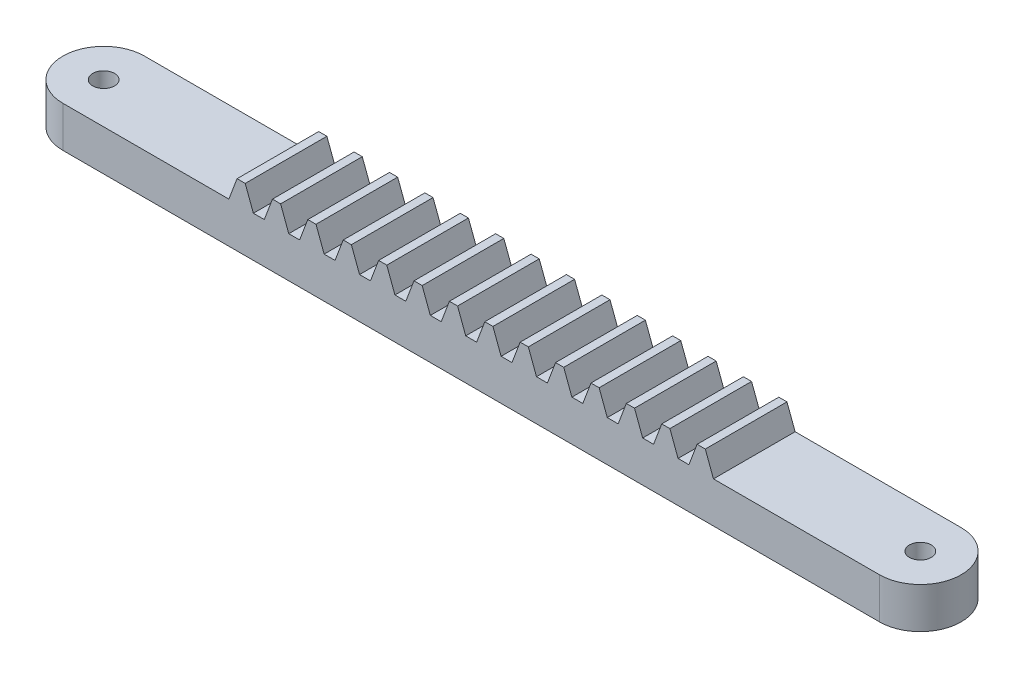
ISO-10303-21;
HEADER;
FILE_DESCRIPTION(('STEP AP214'),'2;1');
FILE_NAME('part.step','',(''),(''),'','','');
FILE_SCHEMA(('AUTOMOTIVE_DESIGN { 1 0 10303 214 1 1 1 1 }'));
ENDSEC;
DATA;
#1=APPLICATION_CONTEXT('core data for automotive mechanical design processes');
#2=APPLICATION_PROTOCOL_DEFINITION('international standard','automotive_design',2000,#1);
#3=PRODUCT_CONTEXT('',#1,'mechanical');
#4=PRODUCT('Part','Part','',(#3));
#5=PRODUCT_RELATED_PRODUCT_CATEGORY('part','',(#4));
#6=PRODUCT_DEFINITION_FORMATION('','',#4);
#7=PRODUCT_DEFINITION_CONTEXT('part definition',#1,'design');
#8=PRODUCT_DEFINITION('design','',#6,#7);
#9=PRODUCT_DEFINITION_SHAPE('','',#8);
#10=(LENGTH_UNIT() NAMED_UNIT(*) SI_UNIT(.MILLI.,.METRE.));
#11=(NAMED_UNIT(*) PLANE_ANGLE_UNIT() SI_UNIT($,.RADIAN.));
#12=(NAMED_UNIT(*) SI_UNIT($,.STERADIAN.) SOLID_ANGLE_UNIT());
#13=UNCERTAINTY_MEASURE_WITH_UNIT(LENGTH_MEASURE(1.E-05),#10,'distance_accuracy_value','');
#14=(GEOMETRIC_REPRESENTATION_CONTEXT(3) GLOBAL_UNCERTAINTY_ASSIGNED_CONTEXT((#13)) GLOBAL_UNIT_ASSIGNED_CONTEXT((#10,
#11,#12)) REPRESENTATION_CONTEXT('',''));
#15=CARTESIAN_POINT('',(0.,0.,0.));
#16=DIRECTION('',(0.,0.,1.));
#17=DIRECTION('',(1.,0.,0.));
#18=AXIS2_PLACEMENT_3D('',#15,#16,#17);
#19=CARTESIAN_POINT('',(0.,3.81,7.62));
#20=DIRECTION('',(0.,-1.,0.));
#21=DIRECTION('',(0.,0.,-1.));
#22=AXIS2_PLACEMENT_3D('',#19,#20,#21);
#23=PLANE('',#22);
#24=DIRECTION('',(-1.,0.,0.));
#25=VECTOR('',#24,1.);
#26=CARTESIAN_POINT('',(0.,3.81,0.));
#27=LINE('',#26,#25);
#28=CARTESIAN_POINT('',(41.91,3.81,0.));
#29=VERTEX_POINT('',#28);
#30=CARTESIAN_POINT('',(40.894,3.81,0.));
#31=VERTEX_POINT('',#30);
#32=EDGE_CURVE('E863',#29,#31,#27,.T.);
#33=ORIENTED_EDGE('',*,*,#32,.T.);
#34=DIRECTION('',(0.,0.,1.));
#35=VECTOR('',#34,1.);
#36=CARTESIAN_POINT('',(40.894,3.81,0.));
#37=LINE('',#36,#35);
#38=CARTESIAN_POINT('',(40.894,3.81,7.62));
#39=VERTEX_POINT('',#38);
#40=EDGE_CURVE('E59',#31,#39,#37,.T.);
#41=ORIENTED_EDGE('',*,*,#40,.T.);
#42=DIRECTION('',(-1.,0.,0.));
#43=VECTOR('',#42,1.);
#44=CARTESIAN_POINT('',(0.,3.81,7.62));
#45=LINE('',#44,#43);
#46=CARTESIAN_POINT('',(41.91,3.81,7.62));
#47=VERTEX_POINT('',#46);
#48=EDGE_CURVE('E922',#47,#39,#45,.T.);
#49=ORIENTED_EDGE('',*,*,#48,.F.);
#50=DIRECTION('',(0.,0.,1.));
#51=VECTOR('',#50,1.);
#52=CARTESIAN_POINT('',(41.91,3.81,0.));
#53=LINE('',#52,#51);
#54=EDGE_CURVE('E503',#29,#47,#53,.T.);
#55=ORIENTED_EDGE('',*,*,#54,.F.);
#56=EDGE_LOOP('',(#33,#41,#49,#55));
#57=FACE_BOUND('',#56,.T.);
#58=ADVANCED_FACE('F33',(#57),#23,.F.);
#59=CARTESIAN_POINT('',(45.212,3.81,0.));
#60=VERTEX_POINT('',#59);
#61=CARTESIAN_POINT('',(44.196,3.81,0.));
#62=VERTEX_POINT('',#61);
#63=EDGE_CURVE('E859',#60,#62,#27,.T.);
#64=ORIENTED_EDGE('',*,*,#63,.T.);
#65=DIRECTION('',(0.,0.,1.));
#66=VECTOR('',#65,1.);
#67=CARTESIAN_POINT('',(44.196,3.81,0.));
#68=LINE('',#67,#66);
#69=CARTESIAN_POINT('',(44.196,3.81,7.62));
#70=VERTEX_POINT('',#69);
#71=EDGE_CURVE('E501',#62,#70,#68,.T.);
#72=ORIENTED_EDGE('',*,*,#71,.T.);
#73=CARTESIAN_POINT('',(45.212,3.81,7.62));
#74=VERTEX_POINT('',#73);
#75=EDGE_CURVE('E919',#74,#70,#45,.T.);
#76=ORIENTED_EDGE('',*,*,#75,.F.);
#77=DIRECTION('',(0.,0.,1.));
#78=VECTOR('',#77,1.);
#79=CARTESIAN_POINT('',(45.212,3.81,0.));
#80=LINE('',#79,#78);
#81=EDGE_CURVE('E530',#60,#74,#80,.T.);
#82=ORIENTED_EDGE('',*,*,#81,.F.);
#83=EDGE_LOOP('',(#64,#72,#76,#82));
#84=FACE_BOUND('',#83,.T.);
#85=ADVANCED_FACE('F966',(#84),#23,.F.);
#86=CARTESIAN_POINT('',(48.514,3.81,0.));
#87=VERTEX_POINT('',#86);
#88=CARTESIAN_POINT('',(47.498,3.81,0.));
#89=VERTEX_POINT('',#88);
#90=EDGE_CURVE('E855',#87,#89,#27,.T.);
#91=ORIENTED_EDGE('',*,*,#90,.T.);
#92=DIRECTION('',(0.,0.,1.));
#93=VECTOR('',#92,1.);
#94=CARTESIAN_POINT('',(47.498,3.81,0.));
#95=LINE('',#94,#93);
#96=CARTESIAN_POINT('',(47.498,3.81,7.62));
#97=VERTEX_POINT('',#96);
#98=EDGE_CURVE('E528',#89,#97,#95,.T.);
#99=ORIENTED_EDGE('',*,*,#98,.T.);
#100=CARTESIAN_POINT('',(48.514,3.81,7.62));
#101=VERTEX_POINT('',#100);
#102=EDGE_CURVE('E916',#101,#97,#45,.T.);
#103=ORIENTED_EDGE('',*,*,#102,.F.);
#104=DIRECTION('',(0.,0.,1.));
#105=VECTOR('',#104,1.);
#106=CARTESIAN_POINT('',(48.514,3.81,0.));
#107=LINE('',#106,#105);
#108=EDGE_CURVE('E557',#87,#101,#107,.T.);
#109=ORIENTED_EDGE('',*,*,#108,.F.);
#110=EDGE_LOOP('',(#91,#99,#103,#109));
#111=FACE_BOUND('',#110,.T.);
#112=ADVANCED_FACE('F971',(#111),#23,.F.);
#113=CARTESIAN_POINT('',(51.816,3.81,0.));
#114=VERTEX_POINT('',#113);
#115=CARTESIAN_POINT('',(50.8,3.81,0.));
#116=VERTEX_POINT('',#115);
#117=EDGE_CURVE('E849',#114,#116,#27,.T.);
#118=ORIENTED_EDGE('',*,*,#117,.T.);
#119=DIRECTION('',(0.,0.,1.));
#120=VECTOR('',#119,1.);
#121=CARTESIAN_POINT('',(50.8,3.81,0.));
#122=LINE('',#121,#120);
#123=CARTESIAN_POINT('',(50.8,3.81,7.62));
#124=VERTEX_POINT('',#123);
#125=EDGE_CURVE('E555',#116,#124,#122,.T.);
#126=ORIENTED_EDGE('',*,*,#125,.T.);
#127=CARTESIAN_POINT('',(51.816,3.81,7.62));
#128=VERTEX_POINT('',#127);
#129=EDGE_CURVE('E911',#128,#124,#45,.T.);
#130=ORIENTED_EDGE('',*,*,#129,.F.);
#131=DIRECTION('',(0.,0.,1.));
#132=VECTOR('',#131,1.);
#133=CARTESIAN_POINT('',(51.816,3.81,0.));
#134=LINE('',#133,#132);
#135=EDGE_CURVE('E584',#114,#128,#134,.T.);
#136=ORIENTED_EDGE('',*,*,#135,.F.);
#137=EDGE_LOOP('',(#118,#126,#130,#136));
#138=FACE_BOUND('',#137,.T.);
#139=ADVANCED_FACE('F1393',(#138),#23,.F.);
#140=CARTESIAN_POINT('',(55.118,3.81,0.));
#141=VERTEX_POINT('',#140);
#142=CARTESIAN_POINT('',(54.102,3.81,0.));
#143=VERTEX_POINT('',#142);
#144=EDGE_CURVE('E847',#141,#143,#27,.T.);
#145=ORIENTED_EDGE('',*,*,#144,.T.);
#146=DIRECTION('',(0.,0.,1.));
#147=VECTOR('',#146,1.);
#148=CARTESIAN_POINT('',(54.102,3.81,0.));
#149=LINE('',#148,#147);
#150=CARTESIAN_POINT('',(54.102,3.81,7.62));
#151=VERTEX_POINT('',#150);
#152=EDGE_CURVE('E582',#143,#151,#149,.T.);
#153=ORIENTED_EDGE('',*,*,#152,.T.);
#154=CARTESIAN_POINT('',(55.118,3.81,7.62));
#155=VERTEX_POINT('',#154);
#156=EDGE_CURVE('E909',#155,#151,#45,.T.);
#157=ORIENTED_EDGE('',*,*,#156,.F.);
#158=DIRECTION('',(0.,0.,1.));
#159=VECTOR('',#158,1.);
#160=CARTESIAN_POINT('',(55.118,3.81,0.));
#161=LINE('',#160,#159);
#162=EDGE_CURVE('E611',#141,#155,#161,.T.);
#163=ORIENTED_EDGE('',*,*,#162,.F.);
#164=EDGE_LOOP('',(#145,#153,#157,#163));
#165=FACE_BOUND('',#164,.T.);
#166=ADVANCED_FACE('F1025',(#165),#23,.F.);
#167=CARTESIAN_POINT('',(58.42,3.81,0.));
#168=VERTEX_POINT('',#167);
#169=CARTESIAN_POINT('',(57.404,3.81,0.));
#170=VERTEX_POINT('',#169);
#171=EDGE_CURVE('E426',#168,#170,#27,.T.);
#172=ORIENTED_EDGE('',*,*,#171,.T.);
#173=DIRECTION('',(0.,0.,1.));
#174=VECTOR('',#173,1.);
#175=CARTESIAN_POINT('',(57.404,3.81,0.));
#176=LINE('',#175,#174);
#177=CARTESIAN_POINT('',(57.404,3.81,7.62));
#178=VERTEX_POINT('',#177);
#179=EDGE_CURVE('E609',#170,#178,#176,.T.);
#180=ORIENTED_EDGE('',*,*,#179,.T.);
#181=CARTESIAN_POINT('',(58.42,3.81,7.62));
#182=VERTEX_POINT('',#181);
#183=EDGE_CURVE('E42',#182,#178,#45,.T.);
#184=ORIENTED_EDGE('',*,*,#183,.F.);
#185=DIRECTION('',(0.,0.,1.));
#186=VECTOR('',#185,1.);
#187=CARTESIAN_POINT('',(58.42,3.81,0.));
#188=LINE('',#187,#186);
#189=EDGE_CURVE('E771',#168,#182,#188,.T.);
#190=ORIENTED_EDGE('',*,*,#189,.F.);
#191=EDGE_LOOP('',(#172,#180,#184,#190));
#192=FACE_BOUND('',#191,.T.);
#193=ADVANCED_FACE('F1020',(#192),#23,.F.);
#194=CARTESIAN_POINT('',(18.796,3.81,0.));
#195=VERTEX_POINT('',#194);
#196=CARTESIAN_POINT('',(17.78,3.81,0.));
#197=VERTEX_POINT('',#196);
#198=EDGE_CURVE('E846',#195,#197,#27,.T.);
#199=ORIENTED_EDGE('',*,*,#198,.T.);
#200=DIRECTION('',(0.,0.,1.));
#201=VECTOR('',#200,1.);
#202=CARTESIAN_POINT('',(17.78,3.81,0.));
#203=LINE('',#202,#201);
#204=CARTESIAN_POINT('',(17.78,3.81,7.62));
#205=VERTEX_POINT('',#204);
#206=EDGE_CURVE('E633',#197,#205,#203,.T.);
#207=ORIENTED_EDGE('',*,*,#206,.T.);
#208=CARTESIAN_POINT('',(18.796,3.81,7.62));
#209=VERTEX_POINT('',#208);
#210=EDGE_CURVE('E904',#209,#205,#45,.T.);
#211=ORIENTED_EDGE('',*,*,#210,.F.);
#212=DIRECTION('',(0.,0.,1.));
#213=VECTOR('',#212,1.);
#214=CARTESIAN_POINT('',(18.796,3.81,0.));
#215=LINE('',#214,#213);
#216=EDGE_CURVE('E663',#195,#209,#215,.T.);
#217=ORIENTED_EDGE('',*,*,#216,.F.);
#218=EDGE_LOOP('',(#199,#207,#211,#217));
#219=FACE_BOUND('',#218,.T.);
#220=ADVANCED_FACE('F1016',(#219),#23,.F.);
#221=CARTESIAN_POINT('',(22.098,3.81,0.));
#222=VERTEX_POINT('',#221);
#223=CARTESIAN_POINT('',(21.082,3.81,0.));
#224=VERTEX_POINT('',#223);
#225=EDGE_CURVE('E848',#222,#224,#27,.T.);
#226=ORIENTED_EDGE('',*,*,#225,.T.);
#227=DIRECTION('',(0.,0.,1.));
#228=VECTOR('',#227,1.);
#229=CARTESIAN_POINT('',(21.082,3.81,0.));
#230=LINE('',#229,#228);
#231=CARTESIAN_POINT('',(21.082,3.81,7.62));
#232=VERTEX_POINT('',#231);
#233=EDGE_CURVE('E660',#224,#232,#230,.T.);
#234=ORIENTED_EDGE('',*,*,#233,.T.);
#235=CARTESIAN_POINT('',(22.098,3.81,7.62));
#236=VERTEX_POINT('',#235);
#237=EDGE_CURVE('E901',#236,#232,#45,.T.);
#238=ORIENTED_EDGE('',*,*,#237,.F.);
#239=DIRECTION('',(0.,0.,1.));
#240=VECTOR('',#239,1.);
#241=CARTESIAN_POINT('',(22.098,3.81,0.));
#242=LINE('',#241,#240);
#243=EDGE_CURVE('E690',#222,#236,#242,.T.);
#244=ORIENTED_EDGE('',*,*,#243,.F.);
#245=EDGE_LOOP('',(#226,#234,#238,#244));
#246=FACE_BOUND('',#245,.T.);
#247=ADVANCED_FACE('F886',(#246),#23,.F.);
#248=CARTESIAN_POINT('',(25.4,3.81,0.));
#249=VERTEX_POINT('',#248);
#250=CARTESIAN_POINT('',(24.384,3.81,0.));
#251=VERTEX_POINT('',#250);
#252=EDGE_CURVE('E876',#249,#251,#27,.T.);
#253=ORIENTED_EDGE('',*,*,#252,.T.);
#254=DIRECTION('',(0.,0.,1.));
#255=VECTOR('',#254,1.);
#256=CARTESIAN_POINT('',(24.384,3.81,0.));
#257=LINE('',#256,#255);
#258=CARTESIAN_POINT('',(24.384,3.81,7.62));
#259=VERTEX_POINT('',#258);
#260=EDGE_CURVE('E687',#251,#259,#257,.T.);
#261=ORIENTED_EDGE('',*,*,#260,.T.);
#262=CARTESIAN_POINT('',(25.4,3.81,7.62));
#263=VERTEX_POINT('',#262);
#264=EDGE_CURVE('E903',#263,#259,#45,.T.);
#265=ORIENTED_EDGE('',*,*,#264,.F.);
#266=DIRECTION('',(0.,0.,1.));
#267=VECTOR('',#266,1.);
#268=CARTESIAN_POINT('',(25.4,3.81,0.));
#269=LINE('',#268,#267);
#270=EDGE_CURVE('E717',#249,#263,#269,.T.);
#271=ORIENTED_EDGE('',*,*,#270,.F.);
#272=EDGE_LOOP('',(#253,#261,#265,#271));
#273=FACE_BOUND('',#272,.T.);
#274=ADVANCED_FACE('F946',(#273),#23,.F.);
#275=CARTESIAN_POINT('',(28.702,3.81,0.));
#276=VERTEX_POINT('',#275);
#277=CARTESIAN_POINT('',(27.686,3.81,0.));
#278=VERTEX_POINT('',#277);
#279=EDGE_CURVE('E854',#276,#278,#27,.T.);
#280=ORIENTED_EDGE('',*,*,#279,.T.);
#281=DIRECTION('',(0.,0.,1.));
#282=VECTOR('',#281,1.);
#283=CARTESIAN_POINT('',(27.686,3.81,0.));
#284=LINE('',#283,#282);
#285=CARTESIAN_POINT('',(27.686,3.81,7.62));
#286=VERTEX_POINT('',#285);
#287=EDGE_CURVE('E714',#278,#286,#284,.T.);
#288=ORIENTED_EDGE('',*,*,#287,.T.);
#289=CARTESIAN_POINT('',(28.702,3.81,7.62));
#290=VERTEX_POINT('',#289);
#291=EDGE_CURVE('E906',#290,#286,#45,.T.);
#292=ORIENTED_EDGE('',*,*,#291,.F.);
#293=DIRECTION('',(0.,0.,1.));
#294=VECTOR('',#293,1.);
#295=CARTESIAN_POINT('',(28.702,3.81,0.));
#296=LINE('',#295,#294);
#297=EDGE_CURVE('E744',#276,#290,#296,.T.);
#298=ORIENTED_EDGE('',*,*,#297,.F.);
#299=EDGE_LOOP('',(#280,#288,#292,#298));
#300=FACE_BOUND('',#299,.T.);
#301=ADVANCED_FACE('F1006',(#300),#23,.F.);
#302=CARTESIAN_POINT('',(32.004,3.81,0.));
#303=VERTEX_POINT('',#302);
#304=CARTESIAN_POINT('',(30.988,3.81,0.));
#305=VERTEX_POINT('',#304);
#306=EDGE_CURVE('E853',#303,#305,#27,.T.);
#307=ORIENTED_EDGE('',*,*,#306,.T.);
#308=DIRECTION('',(0.,0.,1.));
#309=VECTOR('',#308,1.);
#310=CARTESIAN_POINT('',(30.988,3.81,0.));
#311=LINE('',#310,#309);
#312=CARTESIAN_POINT('',(30.988,3.81,7.62));
#313=VERTEX_POINT('',#312);
#314=EDGE_CURVE('E741',#305,#313,#311,.T.);
#315=ORIENTED_EDGE('',*,*,#314,.T.);
#316=CARTESIAN_POINT('',(32.004,3.81,7.62));
#317=VERTEX_POINT('',#316);
#318=EDGE_CURVE('E914',#317,#313,#45,.T.);
#319=ORIENTED_EDGE('',*,*,#318,.F.);
#320=DIRECTION('',(0.,0.,1.));
#321=VECTOR('',#320,1.);
#322=CARTESIAN_POINT('',(32.004,3.81,0.));
#323=LINE('',#322,#321);
#324=EDGE_CURVE('E796',#303,#317,#323,.T.);
#325=ORIENTED_EDGE('',*,*,#324,.F.);
#326=EDGE_LOOP('',(#307,#315,#319,#325));
#327=FACE_BOUND('',#326,.T.);
#328=ADVANCED_FACE('F1001',(#327),#23,.F.);
#329=CARTESIAN_POINT('',(76.2,3.81,3.81));
#330=DIRECTION('',(0.,1.,0.));
#331=DIRECTION('',(0.,0.,1.));
#332=AXIS2_PLACEMENT_3D('',#329,#330,#331);
#333=CIRCLE('',#332,1.016);
#334=CARTESIAN_POINT('',(76.2,3.81,4.826));
#335=VERTEX_POINT('',#334);
#336=EDGE_CURVE('E994',#335,#335,#333,.T.);
#337=ORIENTED_EDGE('',*,*,#336,.F.);
#338=EDGE_LOOP('',(#337));
#339=FACE_BOUND('',#338,.T.);
#340=CARTESIAN_POINT('',(76.2,3.81,7.62));
#341=VERTEX_POINT('',#340);
#342=CARTESIAN_POINT('',(60.706,3.81,7.62));
#343=VERTEX_POINT('',#342);
#344=EDGE_CURVE('E11',#341,#343,#45,.T.);
#345=ORIENTED_EDGE('',*,*,#344,.F.);
#346=CARTESIAN_POINT('',(76.2,3.81,3.81));
#347=DIRECTION('',(0.,1.,0.));
#348=DIRECTION('',(0.,0.,1.));
#349=AXIS2_PLACEMENT_3D('',#346,#347,#348);
#350=CIRCLE('',#349,3.81);
#351=CARTESIAN_POINT('',(76.2,3.81,0.));
#352=VERTEX_POINT('',#351);
#353=EDGE_CURVE('E433',#341,#352,#350,.T.);
#354=ORIENTED_EDGE('',*,*,#353,.T.);
#355=CARTESIAN_POINT('',(60.706,3.81,0.));
#356=VERTEX_POINT('',#355);
#357=EDGE_CURVE('E37',#352,#356,#27,.T.);
#358=ORIENTED_EDGE('',*,*,#357,.T.);
#359=DIRECTION('',(0.,0.,1.));
#360=VECTOR('',#359,1.);
#361=CARTESIAN_POINT('',(60.706,3.81,0.));
#362=LINE('',#361,#360);
#363=EDGE_CURVE('E769',#356,#343,#362,.T.);
#364=ORIENTED_EDGE('',*,*,#363,.T.);
#365=EDGE_LOOP('',(#345,#354,#358,#364));
#366=FACE_BOUND('',#365,.T.);
#367=ADVANCED_FACE('F439',(#339,#366),#23,.F.);
#368=CARTESIAN_POINT('',(35.306,3.81,0.));
#369=VERTEX_POINT('',#368);
#370=CARTESIAN_POINT('',(34.29,3.81,0.));
#371=VERTEX_POINT('',#370);
#372=EDGE_CURVE('E428',#369,#371,#27,.T.);
#373=ORIENTED_EDGE('',*,*,#372,.T.);
#374=DIRECTION('',(0.,0.,1.));
#375=VECTOR('',#374,1.);
#376=CARTESIAN_POINT('',(34.29,3.81,0.));
#377=LINE('',#376,#375);
#378=CARTESIAN_POINT('',(34.29,3.81,7.62));
#379=VERTEX_POINT('',#378);
#380=EDGE_CURVE('E793',#371,#379,#377,.T.);
#381=ORIENTED_EDGE('',*,*,#380,.T.);
#382=CARTESIAN_POINT('',(35.306,3.81,7.62));
#383=VERTEX_POINT('',#382);
#384=EDGE_CURVE('E45',#383,#379,#45,.T.);
#385=ORIENTED_EDGE('',*,*,#384,.F.);
#386=DIRECTION('',(0.,0.,1.));
#387=VECTOR('',#386,1.);
#388=CARTESIAN_POINT('',(35.306,3.81,0.));
#389=LINE('',#388,#387);
#390=EDGE_CURVE('E819',#369,#383,#389,.T.);
#391=ORIENTED_EDGE('',*,*,#390,.F.);
#392=EDGE_LOOP('',(#373,#381,#385,#391));
#393=FACE_BOUND('',#392,.T.);
#394=ADVANCED_FACE('F983',(#393),#23,.F.);
#395=CARTESIAN_POINT('',(0.,3.81,3.81));
#396=DIRECTION('',(0.,1.,0.));
#397=DIRECTION('',(0.,0.,1.));
#398=AXIS2_PLACEMENT_3D('',#395,#396,#397);
#399=CIRCLE('',#398,1.016);
#400=CARTESIAN_POINT('',(0.,3.81,4.826));
#401=VERTEX_POINT('',#400);
#402=EDGE_CURVE('E445',#401,#401,#399,.T.);
#403=ORIENTED_EDGE('',*,*,#402,.F.);
#404=EDGE_LOOP('',(#403));
#405=FACE_BOUND('',#404,.T.);
#406=CARTESIAN_POINT('',(15.494,3.81,0.));
#407=VERTEX_POINT('',#406);
#408=CARTESIAN_POINT('',(0.,3.81,0.));
#409=VERTEX_POINT('',#408);
#410=EDGE_CURVE('E436',#407,#409,#27,.T.);
#411=ORIENTED_EDGE('',*,*,#410,.T.);
#412=CARTESIAN_POINT('',(0.,3.81,3.81));
#413=DIRECTION('',(0.,1.,0.));
#414=DIRECTION('',(0.,0.,1.));
#415=AXIS2_PLACEMENT_3D('',#412,#413,#414);
#416=CIRCLE('',#415,3.81);
#417=CARTESIAN_POINT('',(0.,3.81,7.62));
#418=VERTEX_POINT('',#417);
#419=EDGE_CURVE('E442',#409,#418,#416,.T.);
#420=ORIENTED_EDGE('',*,*,#419,.T.);
#421=CARTESIAN_POINT('',(15.494,3.81,7.62));
#422=VERTEX_POINT('',#421);
#423=EDGE_CURVE('E832',#422,#418,#45,.T.);
#424=ORIENTED_EDGE('',*,*,#423,.F.);
#425=DIRECTION('',(0.,0.,1.));
#426=VECTOR('',#425,1.);
#427=CARTESIAN_POINT('',(15.494,3.81,0.));
#428=LINE('',#427,#426);
#429=EDGE_CURVE('E636',#407,#422,#428,.T.);
#430=ORIENTED_EDGE('',*,*,#429,.F.);
#431=EDGE_LOOP('',(#411,#420,#424,#430));
#432=FACE_BOUND('',#431,.T.);
#433=ADVANCED_FACE('F843',(#405,#432),#23,.F.);
#434=CARTESIAN_POINT('',(0.,0.,7.62));
#435=DIRECTION('',(0.,1.,0.));
#436=DIRECTION('',(0.,0.,1.));
#437=AXIS2_PLACEMENT_3D('',#434,#435,#436);
#438=PLANE('',#437);
#439=CARTESIAN_POINT('',(0.,0.,3.81));
#440=DIRECTION('',(0.,1.,0.));
#441=DIRECTION('',(0.,0.,1.));
#442=AXIS2_PLACEMENT_3D('',#439,#440,#441);
#443=CIRCLE('',#442,1.016);
#444=CARTESIAN_POINT('',(0.,0.,4.826));
#445=VERTEX_POINT('',#444);
#446=EDGE_CURVE('E440',#445,#445,#443,.T.);
#447=ORIENTED_EDGE('',*,*,#446,.T.);
#448=EDGE_LOOP('',(#447));
#449=FACE_BOUND('',#448,.T.);
#450=CARTESIAN_POINT('',(76.2,0.,3.81));
#451=DIRECTION('',(0.,1.,0.));
#452=DIRECTION('',(0.,0.,1.));
#453=AXIS2_PLACEMENT_3D('',#450,#451,#452);
#454=CIRCLE('',#453,1.016);
#455=CARTESIAN_POINT('',(76.2,0.,4.826));
#456=VERTEX_POINT('',#455);
#457=EDGE_CURVE('E991',#456,#456,#454,.T.);
#458=ORIENTED_EDGE('',*,*,#457,.T.);
#459=EDGE_LOOP('',(#458));
#460=FACE_BOUND('',#459,.T.);
#461=DIRECTION('',(1.,0.,0.));
#462=VECTOR('',#461,1.);
#463=CARTESIAN_POINT('',(0.,0.,0.));
#464=LINE('',#463,#462);
#465=CARTESIAN_POINT('',(0.,0.,0.));
#466=VERTEX_POINT('',#465);
#467=CARTESIAN_POINT('',(76.2,0.,0.));
#468=VERTEX_POINT('',#467);
#469=EDGE_CURVE('E437',#466,#468,#464,.T.);
#470=ORIENTED_EDGE('',*,*,#469,.T.);
#471=CARTESIAN_POINT('',(76.2,0.,3.81));
#472=DIRECTION('',(0.,1.,0.));
#473=DIRECTION('',(0.,0.,1.));
#474=AXIS2_PLACEMENT_3D('',#471,#472,#473);
#475=CIRCLE('',#474,3.81);
#476=CARTESIAN_POINT('',(76.2,0.,7.62));
#477=VERTEX_POINT('',#476);
#478=EDGE_CURVE('E435',#477,#468,#475,.T.);
#479=ORIENTED_EDGE('',*,*,#478,.F.);
#480=DIRECTION('',(1.,0.,0.));
#481=VECTOR('',#480,1.);
#482=CARTESIAN_POINT('',(0.,0.,7.62));
#483=LINE('',#482,#481);
#484=CARTESIAN_POINT('',(0.,0.,7.62));
#485=VERTEX_POINT('',#484);
#486=EDGE_CURVE('E829',#485,#477,#483,.T.);
#487=ORIENTED_EDGE('',*,*,#486,.F.);
#488=CARTESIAN_POINT('',(0.,0.,3.81));
#489=DIRECTION('',(0.,1.,0.));
#490=DIRECTION('',(0.,0.,1.));
#491=AXIS2_PLACEMENT_3D('',#488,#489,#490);
#492=CIRCLE('',#491,3.81);
#493=EDGE_CURVE('E449',#466,#485,#492,.T.);
#494=ORIENTED_EDGE('',*,*,#493,.F.);
#495=EDGE_LOOP('',(#470,#479,#487,#494));
#496=FACE_BOUND('',#495,.T.);
#497=ADVANCED_FACE('F35',(#449,#460,#496),#438,.F.);
#498=CARTESIAN_POINT('',(38.608,3.81,7.62));
#499=VERTEX_POINT('',#498);
#500=CARTESIAN_POINT('',(37.592,3.81,7.62));
#501=VERTEX_POINT('',#500);
#502=EDGE_CURVE('E44',#499,#501,#45,.T.);
#503=ORIENTED_EDGE('',*,*,#502,.F.);
#504=DIRECTION('',(0.,0.,1.));
#505=VECTOR('',#504,1.);
#506=CARTESIAN_POINT('',(38.608,3.81,0.));
#507=LINE('',#506,#505);
#508=CARTESIAN_POINT('',(38.608,3.81,0.));
#509=VERTEX_POINT('',#508);
#510=EDGE_CURVE('E475',#509,#499,#507,.T.);
#511=ORIENTED_EDGE('',*,*,#510,.F.);
#512=CARTESIAN_POINT('',(37.592,3.81,0.));
#513=VERTEX_POINT('',#512);
#514=EDGE_CURVE('E427',#509,#513,#27,.T.);
#515=ORIENTED_EDGE('',*,*,#514,.T.);
#516=DIRECTION('',(0.,0.,1.));
#517=VECTOR('',#516,1.);
#518=CARTESIAN_POINT('',(37.592,3.81,0.));
#519=LINE('',#518,#517);
#520=EDGE_CURVE('E811',#513,#501,#519,.T.);
#521=ORIENTED_EDGE('',*,*,#520,.T.);
#522=EDGE_LOOP('',(#503,#511,#515,#521));
#523=FACE_BOUND('',#522,.T.);
#524=ADVANCED_FACE('F967',(#523),#23,.F.);
#525=CARTESIAN_POINT('',(0.,0.,7.62));
#526=DIRECTION('',(0.,0.,-1.));
#527=DIRECTION('',(-1.,0.,0.));
#528=AXIS2_PLACEMENT_3D('',#525,#526,#527);
#529=PLANE('',#528);
#530=DIRECTION('',(0.,-1.,0.));
#531=VECTOR('',#530,1.);
#532=CARTESIAN_POINT('',(0.,0.,7.62));
#533=LINE('',#532,#531);
#534=EDGE_CURVE('E425',#418,#485,#533,.T.);
#535=ORIENTED_EDGE('',*,*,#534,.T.);
#536=ORIENTED_EDGE('',*,*,#486,.T.);
#537=DIRECTION('',(0.,1.,0.));
#538=VECTOR('',#537,1.);
#539=CARTESIAN_POINT('',(76.2,0.,7.62));
#540=LINE('',#539,#538);
#541=EDGE_CURVE('E831',#477,#341,#540,.T.);
#542=ORIENTED_EDGE('',*,*,#541,.T.);
#543=ORIENTED_EDGE('',*,*,#344,.T.);
#544=DIRECTION('',(-0.351123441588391,0.936329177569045,0.));
#545=VECTOR('',#544,1.);
#546=CARTESIAN_POINT('',(59.944,5.842,7.62));
#547=LINE('',#546,#545);
#548=CARTESIAN_POINT('',(59.944,5.842,7.62));
#549=VERTEX_POINT('',#548);
#550=EDGE_CURVE('E754',#343,#549,#547,.T.);
#551=ORIENTED_EDGE('',*,*,#550,.T.);
#552=DIRECTION('',(-1.,0.,0.));
#553=VECTOR('',#552,1.);
#554=CARTESIAN_POINT('',(59.182,5.842,7.62));
#555=LINE('',#554,#553);
#556=CARTESIAN_POINT('',(59.182,5.842,7.62));
#557=VERTEX_POINT('',#556);
#558=EDGE_CURVE('E743',#549,#557,#555,.T.);
#559=ORIENTED_EDGE('',*,*,#558,.T.);
#560=DIRECTION('',(-0.351123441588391,-0.936329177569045,0.));
#561=VECTOR('',#560,1.);
#562=CARTESIAN_POINT('',(58.42,3.81,7.62));
#563=LINE('',#562,#561);
#564=EDGE_CURVE('E761',#557,#182,#563,.T.);
#565=ORIENTED_EDGE('',*,*,#564,.T.);
#566=ORIENTED_EDGE('',*,*,#183,.T.);
#567=DIRECTION('',(-0.351123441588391,0.936329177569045,0.));
#568=VECTOR('',#567,1.);
#569=CARTESIAN_POINT('',(56.642,5.842,7.62));
#570=LINE('',#569,#568);
#571=CARTESIAN_POINT('',(56.642,5.842,7.62));
#572=VERTEX_POINT('',#571);
#573=EDGE_CURVE('E592',#178,#572,#570,.T.);
#574=ORIENTED_EDGE('',*,*,#573,.T.);
#575=DIRECTION('',(-1.,0.,0.));
#576=VECTOR('',#575,1.);
#577=CARTESIAN_POINT('',(55.88,5.842,7.62));
#578=LINE('',#577,#576);
#579=CARTESIAN_POINT('',(55.88,5.842,7.62));
#580=VERTEX_POINT('',#579);
#581=EDGE_CURVE('E581',#572,#580,#578,.T.);
#582=ORIENTED_EDGE('',*,*,#581,.T.);
#583=DIRECTION('',(-0.351123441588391,-0.936329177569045,0.));
#584=VECTOR('',#583,1.);
#585=CARTESIAN_POINT('',(55.118,3.81,7.62));
#586=LINE('',#585,#584);
#587=EDGE_CURVE('E601',#580,#155,#586,.T.);
#588=ORIENTED_EDGE('',*,*,#587,.T.);
#589=ORIENTED_EDGE('',*,*,#156,.T.);
#590=DIRECTION('',(-0.351123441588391,0.936329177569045,0.));
#591=VECTOR('',#590,1.);
#592=CARTESIAN_POINT('',(53.34,5.842,7.62));
#593=LINE('',#592,#591);
#594=CARTESIAN_POINT('',(53.34,5.842,7.62));
#595=VERTEX_POINT('',#594);
#596=EDGE_CURVE('E565',#151,#595,#593,.T.);
#597=ORIENTED_EDGE('',*,*,#596,.T.);
#598=DIRECTION('',(-1.,0.,0.));
#599=VECTOR('',#598,1.);
#600=CARTESIAN_POINT('',(52.578,5.842,7.62));
#601=LINE('',#600,#599);
#602=CARTESIAN_POINT('',(52.578,5.842,7.62));
#603=VERTEX_POINT('',#602);
#604=EDGE_CURVE('E554',#595,#603,#601,.T.);
#605=ORIENTED_EDGE('',*,*,#604,.T.);
#606=DIRECTION('',(-0.351123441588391,-0.936329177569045,0.));
#607=VECTOR('',#606,1.);
#608=CARTESIAN_POINT('',(51.816,3.81,7.62));
#609=LINE('',#608,#607);
#610=EDGE_CURVE('E574',#603,#128,#609,.T.);
#611=ORIENTED_EDGE('',*,*,#610,.T.);
#612=ORIENTED_EDGE('',*,*,#129,.T.);
#613=DIRECTION('',(-0.351123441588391,0.936329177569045,0.));
#614=VECTOR('',#613,1.);
#615=CARTESIAN_POINT('',(50.038,5.842,7.62));
#616=LINE('',#615,#614);
#617=CARTESIAN_POINT('',(50.038,5.842,7.62));
#618=VERTEX_POINT('',#617);
#619=EDGE_CURVE('E538',#124,#618,#616,.T.);
#620=ORIENTED_EDGE('',*,*,#619,.T.);
#621=DIRECTION('',(-1.,0.,0.));
#622=VECTOR('',#621,1.);
#623=CARTESIAN_POINT('',(49.276,5.842,7.62));
#624=LINE('',#623,#622);
#625=CARTESIAN_POINT('',(49.276,5.842,7.62));
#626=VERTEX_POINT('',#625);
#627=EDGE_CURVE('E527',#618,#626,#624,.T.);
#628=ORIENTED_EDGE('',*,*,#627,.T.);
#629=DIRECTION('',(-0.351123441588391,-0.936329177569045,0.));
#630=VECTOR('',#629,1.);
#631=CARTESIAN_POINT('',(48.514,3.81,7.62));
#632=LINE('',#631,#630);
#633=EDGE_CURVE('E547',#626,#101,#632,.T.);
#634=ORIENTED_EDGE('',*,*,#633,.T.);
#635=ORIENTED_EDGE('',*,*,#102,.T.);
#636=DIRECTION('',(-0.351123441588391,0.936329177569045,0.));
#637=VECTOR('',#636,1.);
#638=CARTESIAN_POINT('',(46.736,5.842,7.62));
#639=LINE('',#638,#637);
#640=CARTESIAN_POINT('',(46.736,5.842,7.62));
#641=VERTEX_POINT('',#640);
#642=EDGE_CURVE('E511',#97,#641,#639,.T.);
#643=ORIENTED_EDGE('',*,*,#642,.T.);
#644=DIRECTION('',(-1.,0.,0.));
#645=VECTOR('',#644,1.);
#646=CARTESIAN_POINT('',(45.974,5.842,7.62));
#647=LINE('',#646,#645);
#648=CARTESIAN_POINT('',(45.974,5.842,7.62));
#649=VERTEX_POINT('',#648);
#650=EDGE_CURVE('E500',#641,#649,#647,.T.);
#651=ORIENTED_EDGE('',*,*,#650,.T.);
#652=DIRECTION('',(-0.351123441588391,-0.936329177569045,0.));
#653=VECTOR('',#652,1.);
#654=CARTESIAN_POINT('',(45.212,3.81,7.62));
#655=LINE('',#654,#653);
#656=EDGE_CURVE('E520',#649,#74,#655,.T.);
#657=ORIENTED_EDGE('',*,*,#656,.T.);
#658=ORIENTED_EDGE('',*,*,#75,.T.);
#659=DIRECTION('',(-0.351123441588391,0.936329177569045,0.));
#660=VECTOR('',#659,1.);
#661=CARTESIAN_POINT('',(43.434,5.842,7.62));
#662=LINE('',#661,#660);
#663=CARTESIAN_POINT('',(43.434,5.842,7.62));
#664=VERTEX_POINT('',#663);
#665=EDGE_CURVE('E484',#70,#664,#662,.T.);
#666=ORIENTED_EDGE('',*,*,#665,.T.);
#667=DIRECTION('',(-1.,0.,0.));
#668=VECTOR('',#667,1.);
#669=CARTESIAN_POINT('',(42.672,5.842,7.62));
#670=LINE('',#669,#668);
#671=CARTESIAN_POINT('',(42.672,5.842,7.62));
#672=VERTEX_POINT('',#671);
#673=EDGE_CURVE('E474',#664,#672,#670,.T.);
#674=ORIENTED_EDGE('',*,*,#673,.T.);
#675=DIRECTION('',(-0.351123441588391,-0.936329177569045,0.));
#676=VECTOR('',#675,1.);
#677=CARTESIAN_POINT('',(41.91,3.81,7.62));
#678=LINE('',#677,#676);
#679=EDGE_CURVE('E493',#672,#47,#678,.T.);
#680=ORIENTED_EDGE('',*,*,#679,.T.);
#681=ORIENTED_EDGE('',*,*,#48,.T.);
#682=DIRECTION('',(-0.351123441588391,0.936329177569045,0.));
#683=VECTOR('',#682,1.);
#684=CARTESIAN_POINT('',(40.132,5.842,7.62));
#685=LINE('',#684,#683);
#686=CARTESIAN_POINT('',(40.132,5.842,7.62));
#687=VERTEX_POINT('',#686);
#688=EDGE_CURVE('E452',#39,#687,#685,.T.);
#689=ORIENTED_EDGE('',*,*,#688,.T.);
#690=DIRECTION('',(-1.,0.,0.));
#691=VECTOR('',#690,1.);
#692=CARTESIAN_POINT('',(39.37,5.842,7.62));
#693=LINE('',#692,#691);
#694=CARTESIAN_POINT('',(39.37,5.842,7.62));
#695=VERTEX_POINT('',#694);
#696=EDGE_CURVE('E468',#687,#695,#693,.T.);
#697=ORIENTED_EDGE('',*,*,#696,.T.);
#698=DIRECTION('',(-0.351123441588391,-0.936329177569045,0.));
#699=VECTOR('',#698,1.);
#700=CARTESIAN_POINT('',(38.608,3.81,7.62));
#701=LINE('',#700,#699);
#702=EDGE_CURVE('E459',#695,#499,#701,.T.);
#703=ORIENTED_EDGE('',*,*,#702,.T.);
#704=ORIENTED_EDGE('',*,*,#502,.T.);
#705=DIRECTION('',(-0.351123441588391,0.936329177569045,0.));
#706=VECTOR('',#705,1.);
#707=CARTESIAN_POINT('',(37.592,3.81,7.62));
#708=LINE('',#707,#706);
#709=CARTESIAN_POINT('',(36.83,5.842,7.62));
#710=VERTEX_POINT('',#709);
#711=EDGE_CURVE('E795',#501,#710,#708,.T.);
#712=ORIENTED_EDGE('',*,*,#711,.T.);
#713=DIRECTION('',(-1.,0.,0.));
#714=VECTOR('',#713,1.);
#715=CARTESIAN_POINT('',(36.83,5.842,7.62));
#716=LINE('',#715,#714);
#717=CARTESIAN_POINT('',(36.068,5.842,7.62));
#718=VERTEX_POINT('',#717);
#719=EDGE_CURVE('E814',#710,#718,#716,.T.);
#720=ORIENTED_EDGE('',*,*,#719,.T.);
#721=DIRECTION('',(-0.351123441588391,-0.936329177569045,0.));
#722=VECTOR('',#721,1.);
#723=CARTESIAN_POINT('',(36.068,5.842,7.62));
#724=LINE('',#723,#722);
#725=EDGE_CURVE('E806',#718,#383,#724,.T.);
#726=ORIENTED_EDGE('',*,*,#725,.T.);
#727=ORIENTED_EDGE('',*,*,#384,.T.);
#728=DIRECTION('',(-0.351123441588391,0.936329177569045,0.));
#729=VECTOR('',#728,1.);
#730=CARTESIAN_POINT('',(34.29,3.81,7.62));
#731=LINE('',#730,#729);
#732=CARTESIAN_POINT('',(33.528,5.842,7.62));
#733=VERTEX_POINT('',#732);
#734=EDGE_CURVE('E768',#379,#733,#731,.T.);
#735=ORIENTED_EDGE('',*,*,#734,.T.);
#736=DIRECTION('',(-1.,0.,0.));
#737=VECTOR('',#736,1.);
#738=CARTESIAN_POINT('',(33.528,5.842,7.62));
#739=LINE('',#738,#737);
#740=CARTESIAN_POINT('',(32.766,5.842,7.62));
#741=VERTEX_POINT('',#740);
#742=EDGE_CURVE('E788',#733,#741,#739,.T.);
#743=ORIENTED_EDGE('',*,*,#742,.T.);
#744=DIRECTION('',(-0.351123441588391,-0.936329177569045,0.));
#745=VECTOR('',#744,1.);
#746=CARTESIAN_POINT('',(32.766,5.842,7.62));
#747=LINE('',#746,#745);
#748=EDGE_CURVE('E779',#741,#317,#747,.T.);
#749=ORIENTED_EDGE('',*,*,#748,.T.);
#750=ORIENTED_EDGE('',*,*,#318,.T.);
#751=DIRECTION('',(-0.351123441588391,0.936329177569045,0.));
#752=VECTOR('',#751,1.);
#753=CARTESIAN_POINT('',(30.988,3.81,7.62));
#754=LINE('',#753,#752);
#755=CARTESIAN_POINT('',(30.226,5.842,7.62));
#756=VERTEX_POINT('',#755);
#757=EDGE_CURVE('E716',#313,#756,#754,.T.);
#758=ORIENTED_EDGE('',*,*,#757,.T.);
#759=DIRECTION('',(-1.,0.,0.));
#760=VECTOR('',#759,1.);
#761=CARTESIAN_POINT('',(30.226,5.842,7.62));
#762=LINE('',#761,#760);
#763=CARTESIAN_POINT('',(29.464,5.842,7.62));
#764=VERTEX_POINT('',#763);
#765=EDGE_CURVE('E736',#756,#764,#762,.T.);
#766=ORIENTED_EDGE('',*,*,#765,.T.);
#767=DIRECTION('',(-0.351123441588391,-0.936329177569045,0.));
#768=VECTOR('',#767,1.);
#769=CARTESIAN_POINT('',(29.464,5.842,7.62));
#770=LINE('',#769,#768);
#771=EDGE_CURVE('E727',#764,#290,#770,.T.);
#772=ORIENTED_EDGE('',*,*,#771,.T.);
#773=ORIENTED_EDGE('',*,*,#291,.T.);
#774=DIRECTION('',(-0.351123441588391,0.936329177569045,0.));
#775=VECTOR('',#774,1.);
#776=CARTESIAN_POINT('',(27.686,3.81,7.62));
#777=LINE('',#776,#775);
#778=CARTESIAN_POINT('',(26.924,5.842,7.62));
#779=VERTEX_POINT('',#778);
#780=EDGE_CURVE('E689',#286,#779,#777,.T.);
#781=ORIENTED_EDGE('',*,*,#780,.T.);
#782=DIRECTION('',(-1.,0.,0.));
#783=VECTOR('',#782,1.);
#784=CARTESIAN_POINT('',(26.924,5.842,7.62));
#785=LINE('',#784,#783);
#786=CARTESIAN_POINT('',(26.162,5.842,7.62));
#787=VERTEX_POINT('',#786);
#788=EDGE_CURVE('E709',#779,#787,#785,.T.);
#789=ORIENTED_EDGE('',*,*,#788,.T.);
#790=DIRECTION('',(-0.351123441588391,-0.936329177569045,0.));
#791=VECTOR('',#790,1.);
#792=CARTESIAN_POINT('',(26.162,5.842,7.62));
#793=LINE('',#792,#791);
#794=EDGE_CURVE('E700',#787,#263,#793,.T.);
#795=ORIENTED_EDGE('',*,*,#794,.T.);
#796=ORIENTED_EDGE('',*,*,#264,.T.);
#797=DIRECTION('',(-0.351123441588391,0.936329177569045,0.));
#798=VECTOR('',#797,1.);
#799=CARTESIAN_POINT('',(24.384,3.81,7.62));
#800=LINE('',#799,#798);
#801=CARTESIAN_POINT('',(23.622,5.842,7.62));
#802=VERTEX_POINT('',#801);
#803=EDGE_CURVE('E662',#259,#802,#800,.T.);
#804=ORIENTED_EDGE('',*,*,#803,.T.);
#805=DIRECTION('',(-1.,0.,0.));
#806=VECTOR('',#805,1.);
#807=CARTESIAN_POINT('',(23.622,5.842,7.62));
#808=LINE('',#807,#806);
#809=CARTESIAN_POINT('',(22.86,5.842,7.62));
#810=VERTEX_POINT('',#809);
#811=EDGE_CURVE('E682',#802,#810,#808,.T.);
#812=ORIENTED_EDGE('',*,*,#811,.T.);
#813=DIRECTION('',(-0.351123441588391,-0.936329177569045,0.));
#814=VECTOR('',#813,1.);
#815=CARTESIAN_POINT('',(22.86,5.842,7.62));
#816=LINE('',#815,#814);
#817=EDGE_CURVE('E673',#810,#236,#816,.T.);
#818=ORIENTED_EDGE('',*,*,#817,.T.);
#819=ORIENTED_EDGE('',*,*,#237,.T.);
#820=DIRECTION('',(-0.351123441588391,0.936329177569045,0.));
#821=VECTOR('',#820,1.);
#822=CARTESIAN_POINT('',(21.082,3.81,7.62));
#823=LINE('',#822,#821);
#824=CARTESIAN_POINT('',(20.32,5.842,7.62));
#825=VERTEX_POINT('',#824);
#826=EDGE_CURVE('E635',#232,#825,#823,.T.);
#827=ORIENTED_EDGE('',*,*,#826,.T.);
#828=DIRECTION('',(-1.,0.,0.));
#829=VECTOR('',#828,1.);
#830=CARTESIAN_POINT('',(20.32,5.842,7.62));
#831=LINE('',#830,#829);
#832=CARTESIAN_POINT('',(19.558,5.842,7.62));
#833=VERTEX_POINT('',#832);
#834=EDGE_CURVE('E655',#825,#833,#831,.T.);
#835=ORIENTED_EDGE('',*,*,#834,.T.);
#836=DIRECTION('',(-0.351123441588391,-0.936329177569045,0.));
#837=VECTOR('',#836,1.);
#838=CARTESIAN_POINT('',(19.558,5.842,7.62));
#839=LINE('',#838,#837);
#840=EDGE_CURVE('E646',#833,#209,#839,.T.);
#841=ORIENTED_EDGE('',*,*,#840,.T.);
#842=ORIENTED_EDGE('',*,*,#210,.T.);
#843=DIRECTION('',(-0.351123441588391,0.936329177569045,0.));
#844=VECTOR('',#843,1.);
#845=CARTESIAN_POINT('',(17.78,3.81,7.62));
#846=LINE('',#845,#844);
#847=CARTESIAN_POINT('',(17.018,5.842,7.62));
#848=VERTEX_POINT('',#847);
#849=EDGE_CURVE('E608',#205,#848,#846,.T.);
#850=ORIENTED_EDGE('',*,*,#849,.T.);
#851=DIRECTION('',(-1.,0.,0.));
#852=VECTOR('',#851,1.);
#853=CARTESIAN_POINT('',(17.018,5.842,7.62));
#854=LINE('',#853,#852);
#855=CARTESIAN_POINT('',(16.256,5.842,7.62));
#856=VERTEX_POINT('',#855);
#857=EDGE_CURVE('E628',#848,#856,#854,.T.);
#858=ORIENTED_EDGE('',*,*,#857,.T.);
#859=DIRECTION('',(-0.351123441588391,-0.936329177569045,0.));
#860=VECTOR('',#859,1.);
#861=CARTESIAN_POINT('',(16.256,5.842,7.62));
#862=LINE('',#861,#860);
#863=EDGE_CURVE('E619',#856,#422,#862,.T.);
#864=ORIENTED_EDGE('',*,*,#863,.T.);
#865=ORIENTED_EDGE('',*,*,#423,.T.);
#866=EDGE_LOOP('',(#535,#536,#542,#543,#551,#559,#565,#566,#574,#582,#588,#589,#597,#605,#611,
#612,#620,#628,#634,#635,#643,#651,#657,#658,#666,#674,#680,#681,#689,#697,#703,#704,#712,#720,
#726,#727,#735,#743,#749,#750,#758,#766,#772,#773,#781,#789,#795,#796,#804,#812,#818,#819,#827,
#835,#841,#842,#850,#858,#864,#865));
#867=FACE_BOUND('',#866,.T.);
#868=ADVANCED_FACE('F900',(#867),#529,.F.);
#869=CARTESIAN_POINT('',(0.,0.,0.));
#870=DIRECTION('',(0.,0.,-1.));
#871=DIRECTION('',(-1.,0.,0.));
#872=AXIS2_PLACEMENT_3D('',#869,#870,#871);
#873=PLANE('',#872);
#874=DIRECTION('',(0.,-1.,0.));
#875=VECTOR('',#874,1.);
#876=CARTESIAN_POINT('',(0.,0.,0.));
#877=LINE('',#876,#875);
#878=EDGE_CURVE('E821',#409,#466,#877,.T.);
#879=ORIENTED_EDGE('',*,*,#878,.F.);
#880=ORIENTED_EDGE('',*,*,#410,.F.);
#881=DIRECTION('',(-0.351123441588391,-0.936329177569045,0.));
#882=VECTOR('',#881,1.);
#883=CARTESIAN_POINT('',(16.256,5.842,0.));
#884=LINE('',#883,#882);
#885=CARTESIAN_POINT('',(16.256,5.842,0.));
#886=VERTEX_POINT('',#885);
#887=EDGE_CURVE('E622',#886,#407,#884,.T.);
#888=ORIENTED_EDGE('',*,*,#887,.F.);
#889=DIRECTION('',(-1.,0.,0.));
#890=VECTOR('',#889,1.);
#891=CARTESIAN_POINT('',(17.018,5.842,0.));
#892=LINE('',#891,#890);
#893=CARTESIAN_POINT('',(17.018,5.842,0.));
#894=VERTEX_POINT('',#893);
#895=EDGE_CURVE('E618',#894,#886,#892,.T.);
#896=ORIENTED_EDGE('',*,*,#895,.F.);
#897=DIRECTION('',(-0.351123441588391,0.936329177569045,0.));
#898=VECTOR('',#897,1.);
#899=CARTESIAN_POINT('',(17.78,3.81,0.));
#900=LINE('',#899,#898);
#901=EDGE_CURVE('E615',#197,#894,#900,.T.);
#902=ORIENTED_EDGE('',*,*,#901,.F.);
#903=ORIENTED_EDGE('',*,*,#198,.F.);
#904=DIRECTION('',(-0.351123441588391,-0.936329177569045,0.));
#905=VECTOR('',#904,1.);
#906=CARTESIAN_POINT('',(19.558,5.842,0.));
#907=LINE('',#906,#905);
#908=CARTESIAN_POINT('',(19.558,5.842,0.));
#909=VERTEX_POINT('',#908);
#910=EDGE_CURVE('E649',#909,#195,#907,.T.);
#911=ORIENTED_EDGE('',*,*,#910,.F.);
#912=DIRECTION('',(-1.,0.,0.));
#913=VECTOR('',#912,1.);
#914=CARTESIAN_POINT('',(20.32,5.842,0.));
#915=LINE('',#914,#913);
#916=CARTESIAN_POINT('',(20.32,5.842,0.));
#917=VERTEX_POINT('',#916);
#918=EDGE_CURVE('E645',#917,#909,#915,.T.);
#919=ORIENTED_EDGE('',*,*,#918,.F.);
#920=DIRECTION('',(-0.351123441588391,0.936329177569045,0.));
#921=VECTOR('',#920,1.);
#922=CARTESIAN_POINT('',(21.082,3.81,0.));
#923=LINE('',#922,#921);
#924=EDGE_CURVE('E642',#224,#917,#923,.T.);
#925=ORIENTED_EDGE('',*,*,#924,.F.);
#926=ORIENTED_EDGE('',*,*,#225,.F.);
#927=DIRECTION('',(-0.351123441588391,-0.936329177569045,0.));
#928=VECTOR('',#927,1.);
#929=CARTESIAN_POINT('',(22.86,5.842,0.));
#930=LINE('',#929,#928);
#931=CARTESIAN_POINT('',(22.86,5.842,0.));
#932=VERTEX_POINT('',#931);
#933=EDGE_CURVE('E676',#932,#222,#930,.T.);
#934=ORIENTED_EDGE('',*,*,#933,.F.);
#935=DIRECTION('',(-1.,0.,0.));
#936=VECTOR('',#935,1.);
#937=CARTESIAN_POINT('',(23.622,5.842,0.));
#938=LINE('',#937,#936);
#939=CARTESIAN_POINT('',(23.622,5.842,0.));
#940=VERTEX_POINT('',#939);
#941=EDGE_CURVE('E672',#940,#932,#938,.T.);
#942=ORIENTED_EDGE('',*,*,#941,.F.);
#943=DIRECTION('',(-0.351123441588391,0.936329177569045,0.));
#944=VECTOR('',#943,1.);
#945=CARTESIAN_POINT('',(24.384,3.81,0.));
#946=LINE('',#945,#944);
#947=EDGE_CURVE('E669',#251,#940,#946,.T.);
#948=ORIENTED_EDGE('',*,*,#947,.F.);
#949=ORIENTED_EDGE('',*,*,#252,.F.);
#950=DIRECTION('',(-0.351123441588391,-0.936329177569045,0.));
#951=VECTOR('',#950,1.);
#952=CARTESIAN_POINT('',(26.162,5.842,0.));
#953=LINE('',#952,#951);
#954=CARTESIAN_POINT('',(26.162,5.842,0.));
#955=VERTEX_POINT('',#954);
#956=EDGE_CURVE('E703',#955,#249,#953,.T.);
#957=ORIENTED_EDGE('',*,*,#956,.F.);
#958=DIRECTION('',(-1.,0.,0.));
#959=VECTOR('',#958,1.);
#960=CARTESIAN_POINT('',(26.924,5.842,0.));
#961=LINE('',#960,#959);
#962=CARTESIAN_POINT('',(26.924,5.842,0.));
#963=VERTEX_POINT('',#962);
#964=EDGE_CURVE('E699',#963,#955,#961,.T.);
#965=ORIENTED_EDGE('',*,*,#964,.F.);
#966=DIRECTION('',(-0.351123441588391,0.936329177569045,0.));
#967=VECTOR('',#966,1.);
#968=CARTESIAN_POINT('',(27.686,3.81,0.));
#969=LINE('',#968,#967);
#970=EDGE_CURVE('E696',#278,#963,#969,.T.);
#971=ORIENTED_EDGE('',*,*,#970,.F.);
#972=ORIENTED_EDGE('',*,*,#279,.F.);
#973=DIRECTION('',(-0.351123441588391,-0.936329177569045,0.));
#974=VECTOR('',#973,1.);
#975=CARTESIAN_POINT('',(29.464,5.842,0.));
#976=LINE('',#975,#974);
#977=CARTESIAN_POINT('',(29.464,5.842,0.));
#978=VERTEX_POINT('',#977);
#979=EDGE_CURVE('E730',#978,#276,#976,.T.);
#980=ORIENTED_EDGE('',*,*,#979,.F.);
#981=DIRECTION('',(-1.,0.,0.));
#982=VECTOR('',#981,1.);
#983=CARTESIAN_POINT('',(30.226,5.842,0.));
#984=LINE('',#983,#982);
#985=CARTESIAN_POINT('',(30.226,5.842,0.));
#986=VERTEX_POINT('',#985);
#987=EDGE_CURVE('E726',#986,#978,#984,.T.);
#988=ORIENTED_EDGE('',*,*,#987,.F.);
#989=DIRECTION('',(-0.351123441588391,0.936329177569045,0.));
#990=VECTOR('',#989,1.);
#991=CARTESIAN_POINT('',(30.988,3.81,0.));
#992=LINE('',#991,#990);
#993=EDGE_CURVE('E723',#305,#986,#992,.T.);
#994=ORIENTED_EDGE('',*,*,#993,.F.);
#995=ORIENTED_EDGE('',*,*,#306,.F.);
#996=DIRECTION('',(-0.351123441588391,-0.936329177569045,0.));
#997=VECTOR('',#996,1.);
#998=CARTESIAN_POINT('',(32.766,5.842,0.));
#999=LINE('',#998,#997);
#1000=CARTESIAN_POINT('',(32.766,5.842,0.));
#1001=VERTEX_POINT('',#1000);
#1002=EDGE_CURVE('E782',#1001,#303,#999,.T.);
#1003=ORIENTED_EDGE('',*,*,#1002,.F.);
#1004=DIRECTION('',(-1.,0.,0.));
#1005=VECTOR('',#1004,1.);
#1006=CARTESIAN_POINT('',(33.528,5.842,0.));
#1007=LINE('',#1006,#1005);
#1008=CARTESIAN_POINT('',(33.528,5.842,0.));
#1009=VERTEX_POINT('',#1008);
#1010=EDGE_CURVE('E778',#1009,#1001,#1007,.T.);
#1011=ORIENTED_EDGE('',*,*,#1010,.F.);
#1012=DIRECTION('',(-0.351123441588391,0.936329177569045,0.));
#1013=VECTOR('',#1012,1.);
#1014=CARTESIAN_POINT('',(34.29,3.81,0.));
#1015=LINE('',#1014,#1013);
#1016=EDGE_CURVE('E775',#371,#1009,#1015,.T.);
#1017=ORIENTED_EDGE('',*,*,#1016,.F.);
#1018=ORIENTED_EDGE('',*,*,#372,.F.);
#1019=DIRECTION('',(-0.351123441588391,-0.936329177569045,0.));
#1020=VECTOR('',#1019,1.);
#1021=CARTESIAN_POINT('',(36.068,5.842,0.));
#1022=LINE('',#1021,#1020);
#1023=CARTESIAN_POINT('',(36.068,5.842,0.));
#1024=VERTEX_POINT('',#1023);
#1025=EDGE_CURVE('E809',#1024,#369,#1022,.T.);
#1026=ORIENTED_EDGE('',*,*,#1025,.F.);
#1027=DIRECTION('',(-1.,0.,0.));
#1028=VECTOR('',#1027,1.);
#1029=CARTESIAN_POINT('',(36.83,5.842,0.));
#1030=LINE('',#1029,#1028);
#1031=CARTESIAN_POINT('',(36.83,5.842,0.));
#1032=VERTEX_POINT('',#1031);
#1033=EDGE_CURVE('E805',#1032,#1024,#1030,.T.);
#1034=ORIENTED_EDGE('',*,*,#1033,.F.);
#1035=DIRECTION('',(-0.351123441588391,0.936329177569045,0.));
#1036=VECTOR('',#1035,1.);
#1037=CARTESIAN_POINT('',(37.592,3.81,0.));
#1038=LINE('',#1037,#1036);
#1039=EDGE_CURVE('E802',#513,#1032,#1038,.T.);
#1040=ORIENTED_EDGE('',*,*,#1039,.F.);
#1041=ORIENTED_EDGE('',*,*,#514,.F.);
#1042=DIRECTION('',(-0.351123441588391,-0.936329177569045,0.));
#1043=VECTOR('',#1042,1.);
#1044=CARTESIAN_POINT('',(38.608,3.81,0.));
#1045=LINE('',#1044,#1043);
#1046=CARTESIAN_POINT('',(39.37,5.842,0.));
#1047=VERTEX_POINT('',#1046);
#1048=EDGE_CURVE('E462',#1047,#509,#1045,.T.);
#1049=ORIENTED_EDGE('',*,*,#1048,.F.);
#1050=DIRECTION('',(-1.,0.,0.));
#1051=VECTOR('',#1050,1.);
#1052=CARTESIAN_POINT('',(39.37,5.842,0.));
#1053=LINE('',#1052,#1051);
#1054=CARTESIAN_POINT('',(40.132,5.842,0.));
#1055=VERTEX_POINT('',#1054);
#1056=EDGE_CURVE('E458',#1055,#1047,#1053,.T.);
#1057=ORIENTED_EDGE('',*,*,#1056,.F.);
#1058=DIRECTION('',(-0.351123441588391,0.936329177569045,0.));
#1059=VECTOR('',#1058,1.);
#1060=CARTESIAN_POINT('',(40.132,5.842,0.));
#1061=LINE('',#1060,#1059);
#1062=EDGE_CURVE('E455',#31,#1055,#1061,.T.);
#1063=ORIENTED_EDGE('',*,*,#1062,.F.);
#1064=ORIENTED_EDGE('',*,*,#32,.F.);
#1065=DIRECTION('',(-0.351123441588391,-0.936329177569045,0.));
#1066=VECTOR('',#1065,1.);
#1067=CARTESIAN_POINT('',(41.91,3.81,0.));
#1068=LINE('',#1067,#1066);
#1069=CARTESIAN_POINT('',(42.672,5.842,0.));
#1070=VERTEX_POINT('',#1069);
#1071=EDGE_CURVE('E483',#1070,#29,#1068,.T.);
#1072=ORIENTED_EDGE('',*,*,#1071,.F.);
#1073=DIRECTION('',(-1.,0.,0.));
#1074=VECTOR('',#1073,1.);
#1075=CARTESIAN_POINT('',(42.672,5.842,0.));
#1076=LINE('',#1075,#1074);
#1077=CARTESIAN_POINT('',(43.434,5.842,0.));
#1078=VERTEX_POINT('',#1077);
#1079=EDGE_CURVE('E480',#1078,#1070,#1076,.T.);
#1080=ORIENTED_EDGE('',*,*,#1079,.F.);
#1081=DIRECTION('',(-0.351123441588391,0.936329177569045,0.));
#1082=VECTOR('',#1081,1.);
#1083=CARTESIAN_POINT('',(43.434,5.842,0.));
#1084=LINE('',#1083,#1082);
#1085=EDGE_CURVE('E487',#62,#1078,#1084,.T.);
#1086=ORIENTED_EDGE('',*,*,#1085,.F.);
#1087=ORIENTED_EDGE('',*,*,#63,.F.);
#1088=DIRECTION('',(-0.351123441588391,-0.936329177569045,0.));
#1089=VECTOR('',#1088,1.);
#1090=CARTESIAN_POINT('',(45.212,3.81,0.));
#1091=LINE('',#1090,#1089);
#1092=CARTESIAN_POINT('',(45.974,5.842,0.));
#1093=VERTEX_POINT('',#1092);
#1094=EDGE_CURVE('E510',#1093,#60,#1091,.T.);
#1095=ORIENTED_EDGE('',*,*,#1094,.F.);
#1096=DIRECTION('',(-1.,0.,0.));
#1097=VECTOR('',#1096,1.);
#1098=CARTESIAN_POINT('',(45.974,5.842,0.));
#1099=LINE('',#1098,#1097);
#1100=CARTESIAN_POINT('',(46.736,5.842,0.));
#1101=VERTEX_POINT('',#1100);
#1102=EDGE_CURVE('E507',#1101,#1093,#1099,.T.);
#1103=ORIENTED_EDGE('',*,*,#1102,.F.);
#1104=DIRECTION('',(-0.351123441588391,0.936329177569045,0.));
#1105=VECTOR('',#1104,1.);
#1106=CARTESIAN_POINT('',(46.736,5.842,0.));
#1107=LINE('',#1106,#1105);
#1108=EDGE_CURVE('E514',#89,#1101,#1107,.T.);
#1109=ORIENTED_EDGE('',*,*,#1108,.F.);
#1110=ORIENTED_EDGE('',*,*,#90,.F.);
#1111=DIRECTION('',(-0.351123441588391,-0.936329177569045,0.));
#1112=VECTOR('',#1111,1.);
#1113=CARTESIAN_POINT('',(48.514,3.81,0.));
#1114=LINE('',#1113,#1112);
#1115=CARTESIAN_POINT('',(49.276,5.842,0.));
#1116=VERTEX_POINT('',#1115);
#1117=EDGE_CURVE('E537',#1116,#87,#1114,.T.);
#1118=ORIENTED_EDGE('',*,*,#1117,.F.);
#1119=DIRECTION('',(-1.,0.,0.));
#1120=VECTOR('',#1119,1.);
#1121=CARTESIAN_POINT('',(49.276,5.842,0.));
#1122=LINE('',#1121,#1120);
#1123=CARTESIAN_POINT('',(50.038,5.842,0.));
#1124=VERTEX_POINT('',#1123);
#1125=EDGE_CURVE('E534',#1124,#1116,#1122,.T.);
#1126=ORIENTED_EDGE('',*,*,#1125,.F.);
#1127=DIRECTION('',(-0.351123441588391,0.936329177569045,0.));
#1128=VECTOR('',#1127,1.);
#1129=CARTESIAN_POINT('',(50.038,5.842,0.));
#1130=LINE('',#1129,#1128);
#1131=EDGE_CURVE('E541',#116,#1124,#1130,.T.);
#1132=ORIENTED_EDGE('',*,*,#1131,.F.);
#1133=ORIENTED_EDGE('',*,*,#117,.F.);
#1134=DIRECTION('',(-0.351123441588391,-0.936329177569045,0.));
#1135=VECTOR('',#1134,1.);
#1136=CARTESIAN_POINT('',(51.816,3.81,0.));
#1137=LINE('',#1136,#1135);
#1138=CARTESIAN_POINT('',(52.578,5.842,0.));
#1139=VERTEX_POINT('',#1138);
#1140=EDGE_CURVE('E564',#1139,#114,#1137,.T.);
#1141=ORIENTED_EDGE('',*,*,#1140,.F.);
#1142=DIRECTION('',(-1.,0.,0.));
#1143=VECTOR('',#1142,1.);
#1144=CARTESIAN_POINT('',(52.578,5.842,0.));
#1145=LINE('',#1144,#1143);
#1146=CARTESIAN_POINT('',(53.34,5.842,0.));
#1147=VERTEX_POINT('',#1146);
#1148=EDGE_CURVE('E561',#1147,#1139,#1145,.T.);
#1149=ORIENTED_EDGE('',*,*,#1148,.F.);
#1150=DIRECTION('',(-0.351123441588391,0.936329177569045,0.));
#1151=VECTOR('',#1150,1.);
#1152=CARTESIAN_POINT('',(53.34,5.842,0.));
#1153=LINE('',#1152,#1151);
#1154=EDGE_CURVE('E568',#143,#1147,#1153,.T.);
#1155=ORIENTED_EDGE('',*,*,#1154,.F.);
#1156=ORIENTED_EDGE('',*,*,#144,.F.);
#1157=DIRECTION('',(-0.351123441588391,-0.936329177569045,0.));
#1158=VECTOR('',#1157,1.);
#1159=CARTESIAN_POINT('',(55.118,3.81,0.));
#1160=LINE('',#1159,#1158);
#1161=CARTESIAN_POINT('',(55.88,5.842,0.));
#1162=VERTEX_POINT('',#1161);
#1163=EDGE_CURVE('E591',#1162,#141,#1160,.T.);
#1164=ORIENTED_EDGE('',*,*,#1163,.F.);
#1165=DIRECTION('',(-1.,0.,0.));
#1166=VECTOR('',#1165,1.);
#1167=CARTESIAN_POINT('',(55.88,5.842,0.));
#1168=LINE('',#1167,#1166);
#1169=CARTESIAN_POINT('',(56.642,5.842,0.));
#1170=VERTEX_POINT('',#1169);
#1171=EDGE_CURVE('E588',#1170,#1162,#1168,.T.);
#1172=ORIENTED_EDGE('',*,*,#1171,.F.);
#1173=DIRECTION('',(-0.351123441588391,0.936329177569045,0.));
#1174=VECTOR('',#1173,1.);
#1175=CARTESIAN_POINT('',(56.642,5.842,0.));
#1176=LINE('',#1175,#1174);
#1177=EDGE_CURVE('E595',#170,#1170,#1176,.T.);
#1178=ORIENTED_EDGE('',*,*,#1177,.F.);
#1179=ORIENTED_EDGE('',*,*,#171,.F.);
#1180=DIRECTION('',(-0.351123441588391,-0.936329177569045,0.));
#1181=VECTOR('',#1180,1.);
#1182=CARTESIAN_POINT('',(58.42,3.81,0.));
#1183=LINE('',#1182,#1181);
#1184=CARTESIAN_POINT('',(59.182,5.842,0.));
#1185=VERTEX_POINT('',#1184);
#1186=EDGE_CURVE('E753',#1185,#168,#1183,.T.);
#1187=ORIENTED_EDGE('',*,*,#1186,.F.);
#1188=DIRECTION('',(-1.,0.,0.));
#1189=VECTOR('',#1188,1.);
#1190=CARTESIAN_POINT('',(59.182,5.842,0.));
#1191=LINE('',#1190,#1189);
#1192=CARTESIAN_POINT('',(59.944,5.842,0.));
#1193=VERTEX_POINT('',#1192);
#1194=EDGE_CURVE('E750',#1193,#1185,#1191,.T.);
#1195=ORIENTED_EDGE('',*,*,#1194,.F.);
#1196=DIRECTION('',(-0.351123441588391,0.936329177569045,0.));
#1197=VECTOR('',#1196,1.);
#1198=CARTESIAN_POINT('',(59.944,5.842,0.));
#1199=LINE('',#1198,#1197);
#1200=EDGE_CURVE('E421',#356,#1193,#1199,.T.);
#1201=ORIENTED_EDGE('',*,*,#1200,.F.);
#1202=ORIENTED_EDGE('',*,*,#357,.F.);
#1203=DIRECTION('',(0.,1.,0.));
#1204=VECTOR('',#1203,1.);
#1205=CARTESIAN_POINT('',(76.2,0.,0.));
#1206=LINE('',#1205,#1204);
#1207=EDGE_CURVE('E417',#468,#352,#1206,.T.);
#1208=ORIENTED_EDGE('',*,*,#1207,.F.);
#1209=ORIENTED_EDGE('',*,*,#469,.F.);
#1210=EDGE_LOOP('',(#879,#880,#888,#896,#902,#903,#911,#919,#925,#926,#934,#942,#948,#949,#957,
#965,#971,#972,#980,#988,#994,#995,#1003,#1011,#1017,#1018,#1026,#1034,#1040,#1041,#1049,#1057,
#1063,#1064,#1072,#1080,#1086,#1087,#1095,#1103,#1109,#1110,#1118,#1126,#1132,#1133,#1141,#1149,
#1155,#1156,#1164,#1172,#1178,#1179,#1187,#1195,#1201,#1202,#1208,#1209));
#1211=FACE_BOUND('',#1210,.T.);
#1212=ADVANCED_FACE('F416',(#1211),#873,.T.);
#1213=CARTESIAN_POINT('',(36.068,5.842,0.));
#1214=DIRECTION('',(-0.936329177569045,0.351123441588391,0.));
#1215=DIRECTION('',(-0.351123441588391,-0.936329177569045,0.));
#1216=AXIS2_PLACEMENT_3D('',#1213,#1214,#1215);
#1217=PLANE('',#1216);
#1218=ORIENTED_EDGE('',*,*,#725,.F.);
#1219=DIRECTION('',(0.,0.,1.));
#1220=VECTOR('',#1219,1.);
#1221=CARTESIAN_POINT('',(36.068,5.842,0.));
#1222=LINE('',#1221,#1220);
#1223=EDGE_CURVE('E822',#1024,#718,#1222,.T.);
#1224=ORIENTED_EDGE('',*,*,#1223,.F.);
#1225=ORIENTED_EDGE('',*,*,#1025,.T.);
#1226=ORIENTED_EDGE('',*,*,#390,.T.);
#1227=EDGE_LOOP('',(#1218,#1224,#1225,#1226));
#1228=FACE_BOUND('',#1227,.T.);
#1229=ADVANCED_FACE('F1271',(#1228),#1217,.T.);
#1230=CARTESIAN_POINT('',(36.83,5.842,0.));
#1231=DIRECTION('',(0.,1.,0.));
#1232=DIRECTION('',(-1.,0.,0.));
#1233=AXIS2_PLACEMENT_3D('',#1230,#1231,#1232);
#1234=PLANE('',#1233);
#1235=ORIENTED_EDGE('',*,*,#719,.F.);
#1236=DIRECTION('',(0.,0.,1.));
#1237=VECTOR('',#1236,1.);
#1238=CARTESIAN_POINT('',(36.83,5.842,0.));
#1239=LINE('',#1238,#1237);
#1240=EDGE_CURVE('E824',#1032,#710,#1239,.T.);
#1241=ORIENTED_EDGE('',*,*,#1240,.F.);
#1242=ORIENTED_EDGE('',*,*,#1033,.T.);
#1243=ORIENTED_EDGE('',*,*,#1223,.T.);
#1244=EDGE_LOOP('',(#1235,#1241,#1242,#1243));
#1245=FACE_BOUND('',#1244,.T.);
#1246=ADVANCED_FACE('F1498',(#1245),#1234,.T.);
#1247=CARTESIAN_POINT('',(37.592,3.81,0.));
#1248=DIRECTION('',(0.936329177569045,0.351123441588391,0.));
#1249=DIRECTION('',(-0.351123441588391,0.936329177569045,0.));
#1250=AXIS2_PLACEMENT_3D('',#1247,#1248,#1249);
#1251=PLANE('',#1250);
#1252=ORIENTED_EDGE('',*,*,#711,.F.);
#1253=ORIENTED_EDGE('',*,*,#520,.F.);
#1254=ORIENTED_EDGE('',*,*,#1039,.T.);
#1255=ORIENTED_EDGE('',*,*,#1240,.T.);
#1256=EDGE_LOOP('',(#1252,#1253,#1254,#1255));
#1257=FACE_BOUND('',#1256,.T.);
#1258=ADVANCED_FACE('F1507',(#1257),#1251,.T.);
#1259=CARTESIAN_POINT('',(34.29,3.81,0.));
#1260=DIRECTION('',(0.936329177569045,0.351123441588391,0.));
#1261=DIRECTION('',(-0.351123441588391,0.936329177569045,0.));
#1262=AXIS2_PLACEMENT_3D('',#1259,#1260,#1261);
#1263=PLANE('',#1262);
#1264=ORIENTED_EDGE('',*,*,#734,.F.);
#1265=ORIENTED_EDGE('',*,*,#380,.F.);
#1266=ORIENTED_EDGE('',*,*,#1016,.T.);
#1267=DIRECTION('',(0.,0.,1.));
#1268=VECTOR('',#1267,1.);
#1269=CARTESIAN_POINT('',(33.528,5.842,0.));
#1270=LINE('',#1269,#1268);
#1271=EDGE_CURVE('E785',#1009,#733,#1270,.T.);
#1272=ORIENTED_EDGE('',*,*,#1271,.T.);
#1273=EDGE_LOOP('',(#1264,#1265,#1266,#1272));
#1274=FACE_BOUND('',#1273,.T.);
#1275=ADVANCED_FACE('F1516',(#1274),#1263,.T.);
#1276=CARTESIAN_POINT('',(32.766,5.842,0.));
#1277=DIRECTION('',(-0.936329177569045,0.351123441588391,0.));
#1278=DIRECTION('',(-0.351123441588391,-0.936329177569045,0.));
#1279=AXIS2_PLACEMENT_3D('',#1276,#1277,#1278);
#1280=PLANE('',#1279);
#1281=ORIENTED_EDGE('',*,*,#748,.F.);
#1282=DIRECTION('',(0.,0.,1.));
#1283=VECTOR('',#1282,1.);
#1284=CARTESIAN_POINT('',(32.766,5.842,0.));
#1285=LINE('',#1284,#1283);
#1286=EDGE_CURVE('E799',#1001,#741,#1285,.T.);
#1287=ORIENTED_EDGE('',*,*,#1286,.F.);
#1288=ORIENTED_EDGE('',*,*,#1002,.T.);
#1289=ORIENTED_EDGE('',*,*,#324,.T.);
#1290=EDGE_LOOP('',(#1281,#1287,#1288,#1289));
#1291=FACE_BOUND('',#1290,.T.);
#1292=ADVANCED_FACE('F1525',(#1291),#1280,.T.);
#1293=CARTESIAN_POINT('',(33.528,5.842,0.));
#1294=DIRECTION('',(0.,1.,0.));
#1295=DIRECTION('',(-1.,0.,0.));
#1296=AXIS2_PLACEMENT_3D('',#1293,#1294,#1295);
#1297=PLANE('',#1296);
#1298=ORIENTED_EDGE('',*,*,#742,.F.);
#1299=ORIENTED_EDGE('',*,*,#1271,.F.);
#1300=ORIENTED_EDGE('',*,*,#1010,.T.);
#1301=ORIENTED_EDGE('',*,*,#1286,.T.);
#1302=EDGE_LOOP('',(#1298,#1299,#1300,#1301));
#1303=FACE_BOUND('',#1302,.T.);
#1304=ADVANCED_FACE('F1534',(#1303),#1297,.T.);
#1305=CARTESIAN_POINT('',(59.182,5.842,0.));
#1306=DIRECTION('',(0.,1.,0.));
#1307=DIRECTION('',(-1.,0.,0.));
#1308=AXIS2_PLACEMENT_3D('',#1305,#1306,#1307);
#1309=PLANE('',#1308);
#1310=ORIENTED_EDGE('',*,*,#558,.F.);
#1311=DIRECTION('',(0.,0.,1.));
#1312=VECTOR('',#1311,1.);
#1313=CARTESIAN_POINT('',(59.944,5.842,0.));
#1314=LINE('',#1313,#1312);
#1315=EDGE_CURVE('E766',#1193,#549,#1314,.T.);
#1316=ORIENTED_EDGE('',*,*,#1315,.F.);
#1317=ORIENTED_EDGE('',*,*,#1194,.T.);
#1318=DIRECTION('',(0.,0.,1.));
#1319=VECTOR('',#1318,1.);
#1320=CARTESIAN_POINT('',(59.182,5.842,0.));
#1321=LINE('',#1320,#1319);
#1322=EDGE_CURVE('E758',#1185,#557,#1321,.T.);
#1323=ORIENTED_EDGE('',*,*,#1322,.T.);
#1324=EDGE_LOOP('',(#1310,#1316,#1317,#1323));
#1325=FACE_BOUND('',#1324,.T.);
#1326=ADVANCED_FACE('F1543',(#1325),#1309,.T.);
#1327=CARTESIAN_POINT('',(59.944,5.842,0.));
#1328=DIRECTION('',(0.936329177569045,0.351123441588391,0.));
#1329=DIRECTION('',(-0.351123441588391,0.936329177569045,0.));
#1330=AXIS2_PLACEMENT_3D('',#1327,#1328,#1329);
#1331=PLANE('',#1330);
#1332=ORIENTED_EDGE('',*,*,#550,.F.);
#1333=ORIENTED_EDGE('',*,*,#363,.F.);
#1334=ORIENTED_EDGE('',*,*,#1200,.T.);
#1335=ORIENTED_EDGE('',*,*,#1315,.T.);
#1336=EDGE_LOOP('',(#1332,#1333,#1334,#1335));
#1337=FACE_BOUND('',#1336,.T.);
#1338=ADVANCED_FACE('F1552',(#1337),#1331,.T.);
#1339=CARTESIAN_POINT('',(58.42,3.81,0.));
#1340=DIRECTION('',(-0.936329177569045,0.351123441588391,0.));
#1341=DIRECTION('',(-0.351123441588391,-0.936329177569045,0.));
#1342=AXIS2_PLACEMENT_3D('',#1339,#1340,#1341);
#1343=PLANE('',#1342);
#1344=ORIENTED_EDGE('',*,*,#564,.F.);
#1345=ORIENTED_EDGE('',*,*,#1322,.F.);
#1346=ORIENTED_EDGE('',*,*,#1186,.T.);
#1347=ORIENTED_EDGE('',*,*,#189,.T.);
#1348=EDGE_LOOP('',(#1344,#1345,#1346,#1347));
#1349=FACE_BOUND('',#1348,.T.);
#1350=ADVANCED_FACE('F1561',(#1349),#1343,.T.);
#1351=CARTESIAN_POINT('',(30.988,3.81,0.));
#1352=DIRECTION('',(0.936329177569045,0.351123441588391,0.));
#1353=DIRECTION('',(-0.351123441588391,0.936329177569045,0.));
#1354=AXIS2_PLACEMENT_3D('',#1351,#1352,#1353);
#1355=PLANE('',#1354);
#1356=ORIENTED_EDGE('',*,*,#757,.F.);
#1357=ORIENTED_EDGE('',*,*,#314,.F.);
#1358=ORIENTED_EDGE('',*,*,#993,.T.);
#1359=DIRECTION('',(0.,0.,1.));
#1360=VECTOR('',#1359,1.);
#1361=CARTESIAN_POINT('',(30.226,5.842,0.));
#1362=LINE('',#1361,#1360);
#1363=EDGE_CURVE('E733',#986,#756,#1362,.T.);
#1364=ORIENTED_EDGE('',*,*,#1363,.T.);
#1365=EDGE_LOOP('',(#1356,#1357,#1358,#1364));
#1366=FACE_BOUND('',#1365,.T.);
#1367=ADVANCED_FACE('F1570',(#1366),#1355,.T.);
#1368=CARTESIAN_POINT('',(29.464,5.842,0.));
#1369=DIRECTION('',(-0.936329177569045,0.351123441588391,0.));
#1370=DIRECTION('',(-0.351123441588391,-0.936329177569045,0.));
#1371=AXIS2_PLACEMENT_3D('',#1368,#1369,#1370);
#1372=PLANE('',#1371);
#1373=ORIENTED_EDGE('',*,*,#771,.F.);
#1374=DIRECTION('',(0.,0.,1.));
#1375=VECTOR('',#1374,1.);
#1376=CARTESIAN_POINT('',(29.464,5.842,0.));
#1377=LINE('',#1376,#1375);
#1378=EDGE_CURVE('E747',#978,#764,#1377,.T.);
#1379=ORIENTED_EDGE('',*,*,#1378,.F.);
#1380=ORIENTED_EDGE('',*,*,#979,.T.);
#1381=ORIENTED_EDGE('',*,*,#297,.T.);
#1382=EDGE_LOOP('',(#1373,#1379,#1380,#1381));
#1383=FACE_BOUND('',#1382,.T.);
#1384=ADVANCED_FACE('F1579',(#1383),#1372,.T.);
#1385=CARTESIAN_POINT('',(30.226,5.842,0.));
#1386=DIRECTION('',(0.,1.,0.));
#1387=DIRECTION('',(-1.,0.,0.));
#1388=AXIS2_PLACEMENT_3D('',#1385,#1386,#1387);
#1389=PLANE('',#1388);
#1390=ORIENTED_EDGE('',*,*,#765,.F.);
#1391=ORIENTED_EDGE('',*,*,#1363,.F.);
#1392=ORIENTED_EDGE('',*,*,#987,.T.);
#1393=ORIENTED_EDGE('',*,*,#1378,.T.);
#1394=EDGE_LOOP('',(#1390,#1391,#1392,#1393));
#1395=FACE_BOUND('',#1394,.T.);
#1396=ADVANCED_FACE('F1588',(#1395),#1389,.T.);
#1397=CARTESIAN_POINT('',(27.686,3.81,0.));
#1398=DIRECTION('',(0.936329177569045,0.351123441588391,0.));
#1399=DIRECTION('',(-0.351123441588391,0.936329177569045,0.));
#1400=AXIS2_PLACEMENT_3D('',#1397,#1398,#1399);
#1401=PLANE('',#1400);
#1402=ORIENTED_EDGE('',*,*,#780,.F.);
#1403=ORIENTED_EDGE('',*,*,#287,.F.);
#1404=ORIENTED_EDGE('',*,*,#970,.T.);
#1405=DIRECTION('',(0.,0.,1.));
#1406=VECTOR('',#1405,1.);
#1407=CARTESIAN_POINT('',(26.924,5.842,0.));
#1408=LINE('',#1407,#1406);
#1409=EDGE_CURVE('E706',#963,#779,#1408,.T.);
#1410=ORIENTED_EDGE('',*,*,#1409,.T.);
#1411=EDGE_LOOP('',(#1402,#1403,#1404,#1410));
#1412=FACE_BOUND('',#1411,.T.);
#1413=ADVANCED_FACE('F935',(#1412),#1401,.T.);
#1414=CARTESIAN_POINT('',(26.162,5.842,0.));
#1415=DIRECTION('',(-0.936329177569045,0.351123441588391,0.));
#1416=DIRECTION('',(-0.351123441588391,-0.936329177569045,0.));
#1417=AXIS2_PLACEMENT_3D('',#1414,#1415,#1416);
#1418=PLANE('',#1417);
#1419=ORIENTED_EDGE('',*,*,#794,.F.);
#1420=DIRECTION('',(0.,0.,1.));
#1421=VECTOR('',#1420,1.);
#1422=CARTESIAN_POINT('',(26.162,5.842,0.));
#1423=LINE('',#1422,#1421);
#1424=EDGE_CURVE('E720',#955,#787,#1423,.T.);
#1425=ORIENTED_EDGE('',*,*,#1424,.F.);
#1426=ORIENTED_EDGE('',*,*,#956,.T.);
#1427=ORIENTED_EDGE('',*,*,#270,.T.);
#1428=EDGE_LOOP('',(#1419,#1425,#1426,#1427));
#1429=FACE_BOUND('',#1428,.T.);
#1430=ADVANCED_FACE('F944',(#1429),#1418,.T.);
#1431=CARTESIAN_POINT('',(26.924,5.842,0.));
#1432=DIRECTION('',(0.,1.,0.));
#1433=DIRECTION('',(-1.,0.,0.));
#1434=AXIS2_PLACEMENT_3D('',#1431,#1432,#1433);
#1435=PLANE('',#1434);
#1436=ORIENTED_EDGE('',*,*,#788,.F.);
#1437=ORIENTED_EDGE('',*,*,#1409,.F.);
#1438=ORIENTED_EDGE('',*,*,#964,.T.);
#1439=ORIENTED_EDGE('',*,*,#1424,.T.);
#1440=EDGE_LOOP('',(#1436,#1437,#1438,#1439));
#1441=FACE_BOUND('',#1440,.T.);
#1442=ADVANCED_FACE('F940',(#1441),#1435,.T.);
#1443=CARTESIAN_POINT('',(24.384,3.81,0.));
#1444=DIRECTION('',(0.936329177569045,0.351123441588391,0.));
#1445=DIRECTION('',(-0.351123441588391,0.936329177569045,0.));
#1446=AXIS2_PLACEMENT_3D('',#1443,#1444,#1445);
#1447=PLANE('',#1446);
#1448=ORIENTED_EDGE('',*,*,#803,.F.);
#1449=ORIENTED_EDGE('',*,*,#260,.F.);
#1450=ORIENTED_EDGE('',*,*,#947,.T.);
#1451=DIRECTION('',(0.,0.,1.));
#1452=VECTOR('',#1451,1.);
#1453=CARTESIAN_POINT('',(23.622,5.842,0.));
#1454=LINE('',#1453,#1452);
#1455=EDGE_CURVE('E679',#940,#802,#1454,.T.);
#1456=ORIENTED_EDGE('',*,*,#1455,.T.);
#1457=EDGE_LOOP('',(#1448,#1449,#1450,#1456));
#1458=FACE_BOUND('',#1457,.T.);
#1459=ADVANCED_FACE('F949',(#1458),#1447,.T.);
#1460=CARTESIAN_POINT('',(22.86,5.842,0.));
#1461=DIRECTION('',(-0.936329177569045,0.351123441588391,0.));
#1462=DIRECTION('',(-0.351123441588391,-0.936329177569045,0.));
#1463=AXIS2_PLACEMENT_3D('',#1460,#1461,#1462);
#1464=PLANE('',#1463);
#1465=ORIENTED_EDGE('',*,*,#817,.F.);
#1466=DIRECTION('',(0.,0.,1.));
#1467=VECTOR('',#1466,1.);
#1468=CARTESIAN_POINT('',(22.86,5.842,0.));
#1469=LINE('',#1468,#1467);
#1470=EDGE_CURVE('E693',#932,#810,#1469,.T.);
#1471=ORIENTED_EDGE('',*,*,#1470,.F.);
#1472=ORIENTED_EDGE('',*,*,#933,.T.);
#1473=ORIENTED_EDGE('',*,*,#243,.T.);
#1474=EDGE_LOOP('',(#1465,#1471,#1472,#1473));
#1475=FACE_BOUND('',#1474,.T.);
#1476=ADVANCED_FACE('F955',(#1475),#1464,.T.);
#1477=CARTESIAN_POINT('',(23.622,5.842,0.));
#1478=DIRECTION('',(0.,1.,0.));
#1479=DIRECTION('',(-1.,0.,0.));
#1480=AXIS2_PLACEMENT_3D('',#1477,#1478,#1479);
#1481=PLANE('',#1480);
#1482=ORIENTED_EDGE('',*,*,#811,.F.);
#1483=ORIENTED_EDGE('',*,*,#1455,.F.);
#1484=ORIENTED_EDGE('',*,*,#941,.T.);
#1485=ORIENTED_EDGE('',*,*,#1470,.T.);
#1486=EDGE_LOOP('',(#1482,#1483,#1484,#1485));
#1487=FACE_BOUND('',#1486,.T.);
#1488=ADVANCED_FACE('F953',(#1487),#1481,.T.);
#1489=CARTESIAN_POINT('',(21.082,3.81,0.));
#1490=DIRECTION('',(0.936329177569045,0.351123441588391,0.));
#1491=DIRECTION('',(-0.351123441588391,0.936329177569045,0.));
#1492=AXIS2_PLACEMENT_3D('',#1489,#1490,#1491);
#1493=PLANE('',#1492);
#1494=ORIENTED_EDGE('',*,*,#826,.F.);
#1495=ORIENTED_EDGE('',*,*,#233,.F.);
#1496=ORIENTED_EDGE('',*,*,#924,.T.);
#1497=DIRECTION('',(0.,0.,1.));
#1498=VECTOR('',#1497,1.);
#1499=CARTESIAN_POINT('',(20.32,5.842,0.));
#1500=LINE('',#1499,#1498);
#1501=EDGE_CURVE('E652',#917,#825,#1500,.T.);
#1502=ORIENTED_EDGE('',*,*,#1501,.T.);
#1503=EDGE_LOOP('',(#1494,#1495,#1496,#1502));
#1504=FACE_BOUND('',#1503,.T.);
#1505=ADVANCED_FACE('F892',(#1504),#1493,.T.);
#1506=CARTESIAN_POINT('',(19.558,5.842,0.));
#1507=DIRECTION('',(-0.936329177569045,0.351123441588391,0.));
#1508=DIRECTION('',(-0.351123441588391,-0.936329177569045,0.));
#1509=AXIS2_PLACEMENT_3D('',#1506,#1507,#1508);
#1510=PLANE('',#1509);
#1511=ORIENTED_EDGE('',*,*,#840,.F.);
#1512=DIRECTION('',(0.,0.,1.));
#1513=VECTOR('',#1512,1.);
#1514=CARTESIAN_POINT('',(19.558,5.842,0.));
#1515=LINE('',#1514,#1513);
#1516=EDGE_CURVE('E666',#909,#833,#1515,.T.);
#1517=ORIENTED_EDGE('',*,*,#1516,.F.);
#1518=ORIENTED_EDGE('',*,*,#910,.T.);
#1519=ORIENTED_EDGE('',*,*,#216,.T.);
#1520=EDGE_LOOP('',(#1511,#1517,#1518,#1519));
#1521=FACE_BOUND('',#1520,.T.);
#1522=ADVANCED_FACE('F1051',(#1521),#1510,.T.);
#1523=CARTESIAN_POINT('',(20.32,5.842,0.));
#1524=DIRECTION('',(0.,1.,0.));
#1525=DIRECTION('',(-1.,0.,0.));
#1526=AXIS2_PLACEMENT_3D('',#1523,#1524,#1525);
#1527=PLANE('',#1526);
#1528=ORIENTED_EDGE('',*,*,#834,.F.);
#1529=ORIENTED_EDGE('',*,*,#1501,.F.);
#1530=ORIENTED_EDGE('',*,*,#918,.T.);
#1531=ORIENTED_EDGE('',*,*,#1516,.T.);
#1532=EDGE_LOOP('',(#1528,#1529,#1530,#1531));
#1533=FACE_BOUND('',#1532,.T.);
#1534=ADVANCED_FACE('F897',(#1533),#1527,.T.);
#1535=CARTESIAN_POINT('',(17.78,3.81,0.));
#1536=DIRECTION('',(0.936329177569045,0.351123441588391,0.));
#1537=DIRECTION('',(-0.351123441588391,0.936329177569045,0.));
#1538=AXIS2_PLACEMENT_3D('',#1535,#1536,#1537);
#1539=PLANE('',#1538);
#1540=ORIENTED_EDGE('',*,*,#849,.F.);
#1541=ORIENTED_EDGE('',*,*,#206,.F.);
#1542=ORIENTED_EDGE('',*,*,#901,.T.);
#1543=DIRECTION('',(0.,0.,1.));
#1544=VECTOR('',#1543,1.);
#1545=CARTESIAN_POINT('',(17.018,5.842,0.));
#1546=LINE('',#1545,#1544);
#1547=EDGE_CURVE('E625',#894,#848,#1546,.T.);
#1548=ORIENTED_EDGE('',*,*,#1547,.T.);
#1549=EDGE_LOOP('',(#1540,#1541,#1542,#1548));
#1550=FACE_BOUND('',#1549,.T.);
#1551=ADVANCED_FACE('F1031',(#1550),#1539,.T.);
#1552=CARTESIAN_POINT('',(16.256,5.842,0.));
#1553=DIRECTION('',(-0.936329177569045,0.351123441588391,0.));
#1554=DIRECTION('',(-0.351123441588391,-0.936329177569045,0.));
#1555=AXIS2_PLACEMENT_3D('',#1552,#1553,#1554);
#1556=PLANE('',#1555);
#1557=ORIENTED_EDGE('',*,*,#863,.F.);
#1558=DIRECTION('',(0.,0.,1.));
#1559=VECTOR('',#1558,1.);
#1560=CARTESIAN_POINT('',(16.256,5.842,0.));
#1561=LINE('',#1560,#1559);
#1562=EDGE_CURVE('E639',#886,#856,#1561,.T.);
#1563=ORIENTED_EDGE('',*,*,#1562,.F.);
#1564=ORIENTED_EDGE('',*,*,#887,.T.);
#1565=ORIENTED_EDGE('',*,*,#429,.T.);
#1566=EDGE_LOOP('',(#1557,#1563,#1564,#1565));
#1567=FACE_BOUND('',#1566,.T.);
#1568=ADVANCED_FACE('F1038',(#1567),#1556,.T.);
#1569=CARTESIAN_POINT('',(17.018,5.842,0.));
#1570=DIRECTION('',(0.,1.,0.));
#1571=DIRECTION('',(-1.,0.,0.));
#1572=AXIS2_PLACEMENT_3D('',#1569,#1570,#1571);
#1573=PLANE('',#1572);
#1574=ORIENTED_EDGE('',*,*,#857,.F.);
#1575=ORIENTED_EDGE('',*,*,#1547,.F.);
#1576=ORIENTED_EDGE('',*,*,#895,.T.);
#1577=ORIENTED_EDGE('',*,*,#1562,.T.);
#1578=EDGE_LOOP('',(#1574,#1575,#1576,#1577));
#1579=FACE_BOUND('',#1578,.T.);
#1580=ADVANCED_FACE('F1035',(#1579),#1573,.T.);
#1581=CARTESIAN_POINT('',(55.88,5.842,0.));
#1582=DIRECTION('',(0.,1.,0.));
#1583=DIRECTION('',(-1.,0.,0.));
#1584=AXIS2_PLACEMENT_3D('',#1581,#1582,#1583);
#1585=PLANE('',#1584);
#1586=ORIENTED_EDGE('',*,*,#581,.F.);
#1587=DIRECTION('',(0.,0.,1.));
#1588=VECTOR('',#1587,1.);
#1589=CARTESIAN_POINT('',(56.642,5.842,0.));
#1590=LINE('',#1589,#1588);
#1591=EDGE_CURVE('E606',#1170,#572,#1590,.T.);
#1592=ORIENTED_EDGE('',*,*,#1591,.F.);
#1593=ORIENTED_EDGE('',*,*,#1171,.T.);
#1594=DIRECTION('',(0.,0.,1.));
#1595=VECTOR('',#1594,1.);
#1596=CARTESIAN_POINT('',(55.88,5.842,0.));
#1597=LINE('',#1596,#1595);
#1598=EDGE_CURVE('E598',#1162,#580,#1597,.T.);
#1599=ORIENTED_EDGE('',*,*,#1598,.T.);
#1600=EDGE_LOOP('',(#1586,#1592,#1593,#1599));
#1601=FACE_BOUND('',#1600,.T.);
#1602=ADVANCED_FACE('F1045',(#1601),#1585,.T.);
#1603=CARTESIAN_POINT('',(56.642,5.842,0.));
#1604=DIRECTION('',(0.936329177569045,0.351123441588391,0.));
#1605=DIRECTION('',(-0.351123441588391,0.936329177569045,0.));
#1606=AXIS2_PLACEMENT_3D('',#1603,#1604,#1605);
#1607=PLANE('',#1606);
#1608=ORIENTED_EDGE('',*,*,#573,.F.);
#1609=ORIENTED_EDGE('',*,*,#179,.F.);
#1610=ORIENTED_EDGE('',*,*,#1177,.T.);
#1611=ORIENTED_EDGE('',*,*,#1591,.T.);
#1612=EDGE_LOOP('',(#1608,#1609,#1610,#1611));
#1613=FACE_BOUND('',#1612,.T.);
#1614=ADVANCED_FACE('F1092',(#1613),#1607,.T.);
#1615=CARTESIAN_POINT('',(55.118,3.81,0.));
#1616=DIRECTION('',(-0.936329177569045,0.351123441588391,0.));
#1617=DIRECTION('',(-0.351123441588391,-0.936329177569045,0.));
#1618=AXIS2_PLACEMENT_3D('',#1615,#1616,#1617);
#1619=PLANE('',#1618);
#1620=ORIENTED_EDGE('',*,*,#587,.F.);
#1621=ORIENTED_EDGE('',*,*,#1598,.F.);
#1622=ORIENTED_EDGE('',*,*,#1163,.T.);
#1623=ORIENTED_EDGE('',*,*,#162,.T.);
#1624=EDGE_LOOP('',(#1620,#1621,#1622,#1623));
#1625=FACE_BOUND('',#1624,.T.);
#1626=ADVANCED_FACE('F1101',(#1625),#1619,.T.);
#1627=CARTESIAN_POINT('',(52.578,5.842,0.));
#1628=DIRECTION('',(0.,1.,0.));
#1629=DIRECTION('',(-1.,0.,0.));
#1630=AXIS2_PLACEMENT_3D('',#1627,#1628,#1629);
#1631=PLANE('',#1630);
#1632=ORIENTED_EDGE('',*,*,#604,.F.);
#1633=DIRECTION('',(0.,0.,1.));
#1634=VECTOR('',#1633,1.);
#1635=CARTESIAN_POINT('',(53.34,5.842,0.));
#1636=LINE('',#1635,#1634);
#1637=EDGE_CURVE('E579',#1147,#595,#1636,.T.);
#1638=ORIENTED_EDGE('',*,*,#1637,.F.);
#1639=ORIENTED_EDGE('',*,*,#1148,.T.);
#1640=DIRECTION('',(0.,0.,1.));
#1641=VECTOR('',#1640,1.);
#1642=CARTESIAN_POINT('',(52.578,5.842,0.));
#1643=LINE('',#1642,#1641);
#1644=EDGE_CURVE('E571',#1139,#603,#1643,.T.);
#1645=ORIENTED_EDGE('',*,*,#1644,.T.);
#1646=EDGE_LOOP('',(#1632,#1638,#1639,#1645));
#1647=FACE_BOUND('',#1646,.T.);
#1648=ADVANCED_FACE('F1111',(#1647),#1631,.T.);
#1649=CARTESIAN_POINT('',(53.34,5.842,0.));
#1650=DIRECTION('',(0.936329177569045,0.351123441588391,0.));
#1651=DIRECTION('',(-0.351123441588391,0.936329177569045,0.));
#1652=AXIS2_PLACEMENT_3D('',#1649,#1650,#1651);
#1653=PLANE('',#1652);
#1654=ORIENTED_EDGE('',*,*,#596,.F.);
#1655=ORIENTED_EDGE('',*,*,#152,.F.);
#1656=ORIENTED_EDGE('',*,*,#1154,.T.);
#1657=ORIENTED_EDGE('',*,*,#1637,.T.);
#1658=EDGE_LOOP('',(#1654,#1655,#1656,#1657));
#1659=FACE_BOUND('',#1658,.T.);
#1660=ADVANCED_FACE('F1120',(#1659),#1653,.T.);
#1661=CARTESIAN_POINT('',(51.816,3.81,0.));
#1662=DIRECTION('',(-0.936329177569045,0.351123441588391,0.));
#1663=DIRECTION('',(-0.351123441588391,-0.936329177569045,0.));
#1664=AXIS2_PLACEMENT_3D('',#1661,#1662,#1663);
#1665=PLANE('',#1664);
#1666=ORIENTED_EDGE('',*,*,#610,.F.);
#1667=ORIENTED_EDGE('',*,*,#1644,.F.);
#1668=ORIENTED_EDGE('',*,*,#1140,.T.);
#1669=ORIENTED_EDGE('',*,*,#135,.T.);
#1670=EDGE_LOOP('',(#1666,#1667,#1668,#1669));
#1671=FACE_BOUND('',#1670,.T.);
#1672=ADVANCED_FACE('F1130',(#1671),#1665,.T.);
#1673=CARTESIAN_POINT('',(49.276,5.842,0.));
#1674=DIRECTION('',(0.,1.,0.));
#1675=DIRECTION('',(-1.,0.,0.));
#1676=AXIS2_PLACEMENT_3D('',#1673,#1674,#1675);
#1677=PLANE('',#1676);
#1678=ORIENTED_EDGE('',*,*,#627,.F.);
#1679=DIRECTION('',(0.,0.,1.));
#1680=VECTOR('',#1679,1.);
#1681=CARTESIAN_POINT('',(50.038,5.842,0.));
#1682=LINE('',#1681,#1680);
#1683=EDGE_CURVE('E552',#1124,#618,#1682,.T.);
#1684=ORIENTED_EDGE('',*,*,#1683,.F.);
#1685=ORIENTED_EDGE('',*,*,#1125,.T.);
#1686=DIRECTION('',(0.,0.,1.));
#1687=VECTOR('',#1686,1.);
#1688=CARTESIAN_POINT('',(49.276,5.842,0.));
#1689=LINE('',#1688,#1687);
#1690=EDGE_CURVE('E544',#1116,#626,#1689,.T.);
#1691=ORIENTED_EDGE('',*,*,#1690,.T.);
#1692=EDGE_LOOP('',(#1678,#1684,#1685,#1691));
#1693=FACE_BOUND('',#1692,.T.);
#1694=ADVANCED_FACE('F1140',(#1693),#1677,.T.);
#1695=CARTESIAN_POINT('',(50.038,5.842,0.));
#1696=DIRECTION('',(0.936329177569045,0.351123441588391,0.));
#1697=DIRECTION('',(-0.351123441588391,0.936329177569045,0.));
#1698=AXIS2_PLACEMENT_3D('',#1695,#1696,#1697);
#1699=PLANE('',#1698);
#1700=ORIENTED_EDGE('',*,*,#619,.F.);
#1701=ORIENTED_EDGE('',*,*,#125,.F.);
#1702=ORIENTED_EDGE('',*,*,#1131,.T.);
#1703=ORIENTED_EDGE('',*,*,#1683,.T.);
#1704=EDGE_LOOP('',(#1700,#1701,#1702,#1703));
#1705=FACE_BOUND('',#1704,.T.);
#1706=ADVANCED_FACE('F1150',(#1705),#1699,.T.);
#1707=CARTESIAN_POINT('',(48.514,3.81,0.));
#1708=DIRECTION('',(-0.936329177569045,0.351123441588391,0.));
#1709=DIRECTION('',(-0.351123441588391,-0.936329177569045,0.));
#1710=AXIS2_PLACEMENT_3D('',#1707,#1708,#1709);
#1711=PLANE('',#1710);
#1712=ORIENTED_EDGE('',*,*,#633,.F.);
#1713=ORIENTED_EDGE('',*,*,#1690,.F.);
#1714=ORIENTED_EDGE('',*,*,#1117,.T.);
#1715=ORIENTED_EDGE('',*,*,#108,.T.);
#1716=EDGE_LOOP('',(#1712,#1713,#1714,#1715));
#1717=FACE_BOUND('',#1716,.T.);
#1718=ADVANCED_FACE('F1160',(#1717),#1711,.T.);
#1719=CARTESIAN_POINT('',(45.974,5.842,0.));
#1720=DIRECTION('',(0.,1.,0.));
#1721=DIRECTION('',(-1.,0.,0.));
#1722=AXIS2_PLACEMENT_3D('',#1719,#1720,#1721);
#1723=PLANE('',#1722);
#1724=ORIENTED_EDGE('',*,*,#650,.F.);
#1725=DIRECTION('',(0.,0.,1.));
#1726=VECTOR('',#1725,1.);
#1727=CARTESIAN_POINT('',(46.736,5.842,0.));
#1728=LINE('',#1727,#1726);
#1729=EDGE_CURVE('E525',#1101,#641,#1728,.T.);
#1730=ORIENTED_EDGE('',*,*,#1729,.F.);
#1731=ORIENTED_EDGE('',*,*,#1102,.T.);
#1732=DIRECTION('',(0.,0.,1.));
#1733=VECTOR('',#1732,1.);
#1734=CARTESIAN_POINT('',(45.974,5.842,0.));
#1735=LINE('',#1734,#1733);
#1736=EDGE_CURVE('E517',#1093,#649,#1735,.T.);
#1737=ORIENTED_EDGE('',*,*,#1736,.T.);
#1738=EDGE_LOOP('',(#1724,#1730,#1731,#1737));
#1739=FACE_BOUND('',#1738,.T.);
#1740=ADVANCED_FACE('F1170',(#1739),#1723,.T.);
#1741=CARTESIAN_POINT('',(46.736,5.842,0.));
#1742=DIRECTION('',(0.936329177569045,0.351123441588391,0.));
#1743=DIRECTION('',(-0.351123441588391,0.936329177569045,0.));
#1744=AXIS2_PLACEMENT_3D('',#1741,#1742,#1743);
#1745=PLANE('',#1744);
#1746=ORIENTED_EDGE('',*,*,#642,.F.);
#1747=ORIENTED_EDGE('',*,*,#98,.F.);
#1748=ORIENTED_EDGE('',*,*,#1108,.T.);
#1749=ORIENTED_EDGE('',*,*,#1729,.T.);
#1750=EDGE_LOOP('',(#1746,#1747,#1748,#1749));
#1751=FACE_BOUND('',#1750,.T.);
#1752=ADVANCED_FACE('F1180',(#1751),#1745,.T.);
#1753=CARTESIAN_POINT('',(45.212,3.81,0.));
#1754=DIRECTION('',(-0.936329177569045,0.351123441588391,0.));
#1755=DIRECTION('',(-0.351123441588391,-0.936329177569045,0.));
#1756=AXIS2_PLACEMENT_3D('',#1753,#1754,#1755);
#1757=PLANE('',#1756);
#1758=ORIENTED_EDGE('',*,*,#656,.F.);
#1759=ORIENTED_EDGE('',*,*,#1736,.F.);
#1760=ORIENTED_EDGE('',*,*,#1094,.T.);
#1761=ORIENTED_EDGE('',*,*,#81,.T.);
#1762=EDGE_LOOP('',(#1758,#1759,#1760,#1761));
#1763=FACE_BOUND('',#1762,.T.);
#1764=ADVANCED_FACE('F1190',(#1763),#1757,.T.);
#1765=CARTESIAN_POINT('',(42.672,5.842,0.));
#1766=DIRECTION('',(0.,1.,0.));
#1767=DIRECTION('',(-1.,0.,0.));
#1768=AXIS2_PLACEMENT_3D('',#1765,#1766,#1767);
#1769=PLANE('',#1768);
#1770=ORIENTED_EDGE('',*,*,#673,.F.);
#1771=DIRECTION('',(0.,0.,1.));
#1772=VECTOR('',#1771,1.);
#1773=CARTESIAN_POINT('',(43.434,5.842,0.));
#1774=LINE('',#1773,#1772);
#1775=EDGE_CURVE('E498',#1078,#664,#1774,.T.);
#1776=ORIENTED_EDGE('',*,*,#1775,.F.);
#1777=ORIENTED_EDGE('',*,*,#1079,.T.);
#1778=DIRECTION('',(0.,0.,1.));
#1779=VECTOR('',#1778,1.);
#1780=CARTESIAN_POINT('',(42.672,5.842,0.));
#1781=LINE('',#1780,#1779);
#1782=EDGE_CURVE('E490',#1070,#672,#1781,.T.);
#1783=ORIENTED_EDGE('',*,*,#1782,.T.);
#1784=EDGE_LOOP('',(#1770,#1776,#1777,#1783));
#1785=FACE_BOUND('',#1784,.T.);
#1786=ADVANCED_FACE('F1200',(#1785),#1769,.T.);
#1787=CARTESIAN_POINT('',(43.434,5.842,0.));
#1788=DIRECTION('',(0.936329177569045,0.351123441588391,0.));
#1789=DIRECTION('',(-0.351123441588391,0.936329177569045,0.));
#1790=AXIS2_PLACEMENT_3D('',#1787,#1788,#1789);
#1791=PLANE('',#1790);
#1792=ORIENTED_EDGE('',*,*,#665,.F.);
#1793=ORIENTED_EDGE('',*,*,#71,.F.);
#1794=ORIENTED_EDGE('',*,*,#1085,.T.);
#1795=ORIENTED_EDGE('',*,*,#1775,.T.);
#1796=EDGE_LOOP('',(#1792,#1793,#1794,#1795));
#1797=FACE_BOUND('',#1796,.T.);
#1798=ADVANCED_FACE('F1210',(#1797),#1791,.T.);
#1799=CARTESIAN_POINT('',(41.91,3.81,0.));
#1800=DIRECTION('',(-0.936329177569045,0.351123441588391,0.));
#1801=DIRECTION('',(-0.351123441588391,-0.936329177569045,0.));
#1802=AXIS2_PLACEMENT_3D('',#1799,#1800,#1801);
#1803=PLANE('',#1802);
#1804=ORIENTED_EDGE('',*,*,#679,.F.);
#1805=ORIENTED_EDGE('',*,*,#1782,.F.);
#1806=ORIENTED_EDGE('',*,*,#1071,.T.);
#1807=ORIENTED_EDGE('',*,*,#54,.T.);
#1808=EDGE_LOOP('',(#1804,#1805,#1806,#1807));
#1809=FACE_BOUND('',#1808,.T.);
#1810=ADVANCED_FACE('F1220',(#1809),#1803,.T.);
#1811=CARTESIAN_POINT('',(40.132,5.842,0.));
#1812=DIRECTION('',(0.936329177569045,0.351123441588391,0.));
#1813=DIRECTION('',(-0.351123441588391,0.936329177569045,0.));
#1814=AXIS2_PLACEMENT_3D('',#1811,#1812,#1813);
#1815=PLANE('',#1814);
#1816=ORIENTED_EDGE('',*,*,#688,.F.);
#1817=ORIENTED_EDGE('',*,*,#40,.F.);
#1818=ORIENTED_EDGE('',*,*,#1062,.T.);
#1819=DIRECTION('',(0.,0.,1.));
#1820=VECTOR('',#1819,1.);
#1821=CARTESIAN_POINT('',(40.132,5.842,0.));
#1822=LINE('',#1821,#1820);
#1823=EDGE_CURVE('E465',#1055,#687,#1822,.T.);
#1824=ORIENTED_EDGE('',*,*,#1823,.T.);
#1825=EDGE_LOOP('',(#1816,#1817,#1818,#1824));
#1826=FACE_BOUND('',#1825,.T.);
#1827=ADVANCED_FACE('F1230',(#1826),#1815,.T.);
#1828=CARTESIAN_POINT('',(38.608,3.81,0.));
#1829=DIRECTION('',(-0.936329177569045,0.351123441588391,0.));
#1830=DIRECTION('',(-0.351123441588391,-0.936329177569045,0.));
#1831=AXIS2_PLACEMENT_3D('',#1828,#1829,#1830);
#1832=PLANE('',#1831);
#1833=ORIENTED_EDGE('',*,*,#702,.F.);
#1834=DIRECTION('',(0.,0.,1.));
#1835=VECTOR('',#1834,1.);
#1836=CARTESIAN_POINT('',(39.37,5.842,0.));
#1837=LINE('',#1836,#1835);
#1838=EDGE_CURVE('E477',#1047,#695,#1837,.T.);
#1839=ORIENTED_EDGE('',*,*,#1838,.F.);
#1840=ORIENTED_EDGE('',*,*,#1048,.T.);
#1841=ORIENTED_EDGE('',*,*,#510,.T.);
#1842=EDGE_LOOP('',(#1833,#1839,#1840,#1841));
#1843=FACE_BOUND('',#1842,.T.);
#1844=ADVANCED_FACE('F1240',(#1843),#1832,.T.);
#1845=CARTESIAN_POINT('',(39.37,5.842,0.));
#1846=DIRECTION('',(0.,1.,0.));
#1847=DIRECTION('',(-1.,0.,0.));
#1848=AXIS2_PLACEMENT_3D('',#1845,#1846,#1847);
#1849=PLANE('',#1848);
#1850=ORIENTED_EDGE('',*,*,#696,.F.);
#1851=ORIENTED_EDGE('',*,*,#1823,.F.);
#1852=ORIENTED_EDGE('',*,*,#1056,.T.);
#1853=ORIENTED_EDGE('',*,*,#1838,.T.);
#1854=EDGE_LOOP('',(#1850,#1851,#1852,#1853));
#1855=FACE_BOUND('',#1854,.T.);
#1856=ADVANCED_FACE('F1250',(#1855),#1849,.T.);
#1857=CARTESIAN_POINT('',(0.,0.,3.81));
#1858=DIRECTION('',(0.,1.,0.));
#1859=DIRECTION('',(0.,0.,1.));
#1860=AXIS2_PLACEMENT_3D('',#1857,#1858,#1859);
#1861=CYLINDRICAL_SURFACE('',#1860,3.81);
#1862=ORIENTED_EDGE('',*,*,#493,.T.);
#1863=ORIENTED_EDGE('',*,*,#534,.F.);
#1864=ORIENTED_EDGE('',*,*,#419,.F.);
#1865=ORIENTED_EDGE('',*,*,#878,.T.);
#1866=EDGE_LOOP('',(#1862,#1863,#1864,#1865));
#1867=FACE_BOUND('',#1866,.T.);
#1868=ADVANCED_FACE('F840',(#1867),#1861,.T.);
#1869=CARTESIAN_POINT('',(76.2,0.,3.81));
#1870=DIRECTION('',(0.,1.,0.));
#1871=DIRECTION('',(0.,0.,1.));
#1872=AXIS2_PLACEMENT_3D('',#1869,#1870,#1871);
#1873=CYLINDRICAL_SURFACE('',#1872,3.81);
#1874=ORIENTED_EDGE('',*,*,#541,.F.);
#1875=ORIENTED_EDGE('',*,*,#478,.T.);
#1876=ORIENTED_EDGE('',*,*,#1207,.T.);
#1877=ORIENTED_EDGE('',*,*,#353,.F.);
#1878=EDGE_LOOP('',(#1874,#1875,#1876,#1877));
#1879=FACE_BOUND('',#1878,.T.);
#1880=ADVANCED_FACE('F432',(#1879),#1873,.T.);
#1881=CARTESIAN_POINT('',(76.2,0.,3.81));
#1882=DIRECTION('',(0.,1.,0.));
#1883=DIRECTION('',(0.,0.,1.));
#1884=AXIS2_PLACEMENT_3D('',#1881,#1882,#1883);
#1885=CYLINDRICAL_SURFACE('',#1884,1.016);
#1886=CARTESIAN_POINT('',(76.2,0.,4.826));
#1887=CARTESIAN_POINT('',(76.2,0.0396874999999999,4.826));
#1888=CARTESIAN_POINT('',(76.2,0.079375,4.826));
#1889=CARTESIAN_POINT('',(76.2,0.15875,4.826));
#1890=CARTESIAN_POINT('',(76.2,0.1984375,4.826));
#1891=CARTESIAN_POINT('',(76.2,0.2778125,4.826));
#1892=CARTESIAN_POINT('',(76.2,0.3175,4.826));
#1893=CARTESIAN_POINT('',(76.2,0.396875,4.826));
#1894=CARTESIAN_POINT('',(76.2,0.4365625,4.826));
#1895=CARTESIAN_POINT('',(76.2,0.5159375,4.826));
#1896=CARTESIAN_POINT('',(76.2,0.555625,4.826));
#1897=CARTESIAN_POINT('',(76.2,0.635,4.826));
#1898=CARTESIAN_POINT('',(76.2,0.6746875,4.826));
#1899=CARTESIAN_POINT('',(76.2,0.7540625,4.826));
#1900=CARTESIAN_POINT('',(76.2,0.79375,4.826));
#1901=CARTESIAN_POINT('',(76.2,0.873125,4.826));
#1902=CARTESIAN_POINT('',(76.2,0.9128125,4.826));
#1903=CARTESIAN_POINT('',(76.2,0.9921875,4.826));
#1904=CARTESIAN_POINT('',(76.2,1.031875,4.826));
#1905=CARTESIAN_POINT('',(76.2,1.11125,4.826));
#1906=CARTESIAN_POINT('',(76.2,1.1509375,4.826));
#1907=CARTESIAN_POINT('',(76.2,1.2303125,4.826));
#1908=CARTESIAN_POINT('',(76.2,1.27,4.826));
#1909=CARTESIAN_POINT('',(76.2,1.349375,4.826));
#1910=CARTESIAN_POINT('',(76.2,1.3890625,4.826));
#1911=CARTESIAN_POINT('',(76.2,1.4684375,4.826));
#1912=CARTESIAN_POINT('',(76.2,1.508125,4.826));
#1913=CARTESIAN_POINT('',(76.2,1.5875,4.826));
#1914=CARTESIAN_POINT('',(76.2,1.6271875,4.826));
#1915=CARTESIAN_POINT('',(76.2,1.7065625,4.826));
#1916=CARTESIAN_POINT('',(76.2,1.74625,4.826));
#1917=CARTESIAN_POINT('',(76.2,1.825625,4.826));
#1918=CARTESIAN_POINT('',(76.2,1.8653125,4.826));
#1919=CARTESIAN_POINT('',(76.2,1.9446875,4.826));
#1920=CARTESIAN_POINT('',(76.2,1.984375,4.826));
#1921=CARTESIAN_POINT('',(76.2,2.06375,4.826));
#1922=CARTESIAN_POINT('',(76.2,2.1034375,4.826));
#1923=CARTESIAN_POINT('',(76.2,2.1828125,4.826));
#1924=CARTESIAN_POINT('',(76.2,2.2225,4.826));
#1925=CARTESIAN_POINT('',(76.2,2.301875,4.826));
#1926=CARTESIAN_POINT('',(76.2,2.3415625,4.826));
#1927=CARTESIAN_POINT('',(76.2,2.4209375,4.826));
#1928=CARTESIAN_POINT('',(76.2,2.460625,4.826));
#1929=CARTESIAN_POINT('',(76.2,2.54,4.826));
#1930=CARTESIAN_POINT('',(76.2,2.5796875,4.826));
#1931=CARTESIAN_POINT('',(76.2,2.6590625,4.826));
#1932=CARTESIAN_POINT('',(76.2,2.69875,4.826));
#1933=CARTESIAN_POINT('',(76.2,2.778125,4.826));
#1934=CARTESIAN_POINT('',(76.2,2.8178125,4.826));
#1935=CARTESIAN_POINT('',(76.2,2.8971875,4.826));
#1936=CARTESIAN_POINT('',(76.2,2.936875,4.826));
#1937=CARTESIAN_POINT('',(76.2,3.01625,4.826));
#1938=CARTESIAN_POINT('',(76.2,3.0559375,4.826));
#1939=CARTESIAN_POINT('',(76.2,3.1353125,4.826));
#1940=CARTESIAN_POINT('',(76.2,3.175,4.826));
#1941=CARTESIAN_POINT('',(76.2,3.254375,4.826));
#1942=CARTESIAN_POINT('',(76.2,3.2940625,4.826));
#1943=CARTESIAN_POINT('',(76.2,3.3734375,4.826));
#1944=CARTESIAN_POINT('',(76.2,3.413125,4.826));
#1945=CARTESIAN_POINT('',(76.2,3.4925,4.826));
#1946=CARTESIAN_POINT('',(76.2,3.5321875,4.826));
#1947=CARTESIAN_POINT('',(76.2,3.6115625,4.826));
#1948=CARTESIAN_POINT('',(76.2,3.65125,4.826));
#1949=CARTESIAN_POINT('',(76.2,3.730625,4.826));
#1950=CARTESIAN_POINT('',(76.2,3.7703125,4.826));
#1951=CARTESIAN_POINT('',(76.2,3.81,4.826));
#1952=B_SPLINE_CURVE_WITH_KNOTS('',3,(#1886,#1887,#1888,#1889,#1890,#1891,#1892,#1893,#1894,
#1895,#1896,#1897,#1898,#1899,#1900,#1901,#1902,#1903,#1904,#1905,#1906,#1907,#1908,#1909,#1910,
#1911,#1912,#1913,#1914,#1915,#1916,#1917,#1918,#1919,#1920,#1921,#1922,#1923,#1924,#1925,#1926,
#1927,#1928,#1929,#1930,#1931,#1932,#1933,#1934,#1935,#1936,#1937,#1938,#1939,#1940,#1941,#1942,
#1943,#1944,#1945,#1946,#1947,#1948,#1949,#1950,#1951),.UNSPECIFIED.,.F.,.F.,(4,2,2,2,2,2,2,2,2,
2,2,2,2,2,2,2,2,2,2,2,2,2,2,2,2,2,2,2,2,2,2,2,4),(0.,0.1190625,0.238125,0.3571875,0.47625,
0.5953125,0.714375,0.8334375,0.9525,1.0715625,1.190625,1.3096875,1.42875,1.5478125,1.666875,
1.7859375,1.905,2.0240625,2.143125,2.2621875,2.38125,2.5003125,2.619375,2.7384375,2.8575,
2.9765625,3.095625,3.2146875,3.33375,3.4528125,3.571875,3.6909375,3.81),.UNSPECIFIED.);
#1953=EDGE_CURVE('BSEAM999',#456,#335,#1952,.T.);
#1954=ORIENTED_EDGE('',*,*,#457,.F.);
#1955=ORIENTED_EDGE('',*,*,#336,.T.);
#1956=ORIENTED_EDGE('',*,*,#1953,.T.);
#1957=ORIENTED_EDGE('',*,*,#1953,.F.);
#1958=EDGE_LOOP('',(#1954,#1956,#1955,#1957));
#1959=FACE_BOUND('',#1958,.T.);
#1960=ADVANCED_FACE('F999',(#1959),#1885,.F.);
#1961=CARTESIAN_POINT('',(0.,0.,3.81));
#1962=DIRECTION('',(0.,1.,0.));
#1963=DIRECTION('',(0.,0.,1.));
#1964=AXIS2_PLACEMENT_3D('',#1961,#1962,#1963);
#1965=CYLINDRICAL_SURFACE('',#1964,1.016);
#1966=CARTESIAN_POINT('',(0.,0.,4.826));
#1967=CARTESIAN_POINT('',(0.,0.0396874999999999,4.826));
#1968=CARTESIAN_POINT('',(0.,0.079375,4.826));
#1969=CARTESIAN_POINT('',(0.,0.15875,4.826));
#1970=CARTESIAN_POINT('',(0.,0.1984375,4.826));
#1971=CARTESIAN_POINT('',(0.,0.2778125,4.826));
#1972=CARTESIAN_POINT('',(0.,0.3175,4.826));
#1973=CARTESIAN_POINT('',(0.,0.396875,4.826));
#1974=CARTESIAN_POINT('',(0.,0.4365625,4.826));
#1975=CARTESIAN_POINT('',(0.,0.5159375,4.826));
#1976=CARTESIAN_POINT('',(0.,0.555625,4.826));
#1977=CARTESIAN_POINT('',(0.,0.635,4.826));
#1978=CARTESIAN_POINT('',(0.,0.6746875,4.826));
#1979=CARTESIAN_POINT('',(0.,0.7540625,4.826));
#1980=CARTESIAN_POINT('',(0.,0.79375,4.826));
#1981=CARTESIAN_POINT('',(0.,0.873125,4.826));
#1982=CARTESIAN_POINT('',(0.,0.9128125,4.826));
#1983=CARTESIAN_POINT('',(0.,0.9921875,4.826));
#1984=CARTESIAN_POINT('',(0.,1.031875,4.826));
#1985=CARTESIAN_POINT('',(0.,1.11125,4.826));
#1986=CARTESIAN_POINT('',(0.,1.1509375,4.826));
#1987=CARTESIAN_POINT('',(0.,1.2303125,4.826));
#1988=CARTESIAN_POINT('',(0.,1.27,4.826));
#1989=CARTESIAN_POINT('',(0.,1.349375,4.826));
#1990=CARTESIAN_POINT('',(0.,1.3890625,4.826));
#1991=CARTESIAN_POINT('',(0.,1.4684375,4.826));
#1992=CARTESIAN_POINT('',(0.,1.508125,4.826));
#1993=CARTESIAN_POINT('',(0.,1.5875,4.826));
#1994=CARTESIAN_POINT('',(0.,1.6271875,4.826));
#1995=CARTESIAN_POINT('',(0.,1.7065625,4.826));
#1996=CARTESIAN_POINT('',(0.,1.74625,4.826));
#1997=CARTESIAN_POINT('',(0.,1.825625,4.826));
#1998=CARTESIAN_POINT('',(0.,1.8653125,4.826));
#1999=CARTESIAN_POINT('',(0.,1.9446875,4.826));
#2000=CARTESIAN_POINT('',(0.,1.984375,4.826));
#2001=CARTESIAN_POINT('',(0.,2.06375,4.826));
#2002=CARTESIAN_POINT('',(0.,2.1034375,4.826));
#2003=CARTESIAN_POINT('',(0.,2.1828125,4.826));
#2004=CARTESIAN_POINT('',(0.,2.2225,4.826));
#2005=CARTESIAN_POINT('',(0.,2.301875,4.826));
#2006=CARTESIAN_POINT('',(0.,2.3415625,4.826));
#2007=CARTESIAN_POINT('',(0.,2.4209375,4.826));
#2008=CARTESIAN_POINT('',(0.,2.460625,4.826));
#2009=CARTESIAN_POINT('',(0.,2.54,4.826));
#2010=CARTESIAN_POINT('',(0.,2.5796875,4.826));
#2011=CARTESIAN_POINT('',(0.,2.6590625,4.826));
#2012=CARTESIAN_POINT('',(0.,2.69875,4.826));
#2013=CARTESIAN_POINT('',(0.,2.778125,4.826));
#2014=CARTESIAN_POINT('',(0.,2.8178125,4.826));
#2015=CARTESIAN_POINT('',(0.,2.8971875,4.826));
#2016=CARTESIAN_POINT('',(0.,2.936875,4.826));
#2017=CARTESIAN_POINT('',(0.,3.01625,4.826));
#2018=CARTESIAN_POINT('',(0.,3.0559375,4.826));
#2019=CARTESIAN_POINT('',(0.,3.1353125,4.826));
#2020=CARTESIAN_POINT('',(0.,3.175,4.826));
#2021=CARTESIAN_POINT('',(0.,3.254375,4.826));
#2022=CARTESIAN_POINT('',(0.,3.2940625,4.826));
#2023=CARTESIAN_POINT('',(0.,3.3734375,4.826));
#2024=CARTESIAN_POINT('',(0.,3.413125,4.826));
#2025=CARTESIAN_POINT('',(0.,3.4925,4.826));
#2026=CARTESIAN_POINT('',(0.,3.5321875,4.826));
#2027=CARTESIAN_POINT('',(0.,3.6115625,4.826));
#2028=CARTESIAN_POINT('',(0.,3.65125,4.826));
#2029=CARTESIAN_POINT('',(0.,3.730625,4.826));
#2030=CARTESIAN_POINT('',(0.,3.7703125,4.826));
#2031=CARTESIAN_POINT('',(0.,3.81,4.826));
#2032=B_SPLINE_CURVE_WITH_KNOTS('',3,(#1966,#1967,#1968,#1969,#1970,#1971,#1972,#1973,#1974,
#1975,#1976,#1977,#1978,#1979,#1980,#1981,#1982,#1983,#1984,#1985,#1986,#1987,#1988,#1989,#1990,
#1991,#1992,#1993,#1994,#1995,#1996,#1997,#1998,#1999,#2000,#2001,#2002,#2003,#2004,#2005,#2006,
#2007,#2008,#2009,#2010,#2011,#2012,#2013,#2014,#2015,#2016,#2017,#2018,#2019,#2020,#2021,#2022,
#2023,#2024,#2025,#2026,#2027,#2028,#2029,#2030,#2031),.UNSPECIFIED.,.F.,.F.,(4,2,2,2,2,2,2,2,2,
2,2,2,2,2,2,2,2,2,2,2,2,2,2,2,2,2,2,2,2,2,2,2,4),(0.,0.1190625,0.238125,0.3571875,0.47625,
0.5953125,0.714375,0.8334375,0.9525,1.0715625,1.190625,1.3096875,1.42875,1.5478125,1.666875,
1.7859375,1.905,2.0240625,2.143125,2.2621875,2.38125,2.5003125,2.619375,2.7384375,2.8575,
2.9765625,3.095625,3.2146875,3.33375,3.4528125,3.571875,3.6909375,3.81),.UNSPECIFIED.);
#2033=EDGE_CURVE('BSEAM1311',#445,#401,#2032,.T.);
#2034=ORIENTED_EDGE('',*,*,#446,.F.);
#2035=ORIENTED_EDGE('',*,*,#402,.T.);
#2036=ORIENTED_EDGE('',*,*,#2033,.T.);
#2037=ORIENTED_EDGE('',*,*,#2033,.F.);
#2038=EDGE_LOOP('',(#2034,#2036,#2035,#2037));
#2039=FACE_BOUND('',#2038,.T.);
#2040=ADVANCED_FACE('F1311',(#2039),#1965,.F.);
#2041=CLOSED_SHELL('',(#58,#85,#112,#139,#166,#193,#220,#247,#274,#301,#328,#367,#394,#433,#497,
#524,#868,#1212,#1229,#1246,#1258,#1275,#1292,#1304,#1326,#1338,#1350,#1367,#1384,#1396,#1413,
#1430,#1442,#1459,#1476,#1488,#1505,#1522,#1534,#1551,#1568,#1580,#1602,#1614,#1626,#1648,#1660,
#1672,#1694,#1706,#1718,#1740,#1752,#1764,#1786,#1798,#1810,#1827,#1844,#1856,#1868,#1880,#1960,#2040));
#2042=MANIFOLD_SOLID_BREP('B2',#2041);
#2043=ADVANCED_BREP_SHAPE_REPRESENTATION('',(#18,#2042),#14);
#2044=SHAPE_DEFINITION_REPRESENTATION(#9,#2043);
ENDSEC;
END-ISO-10303-21;
